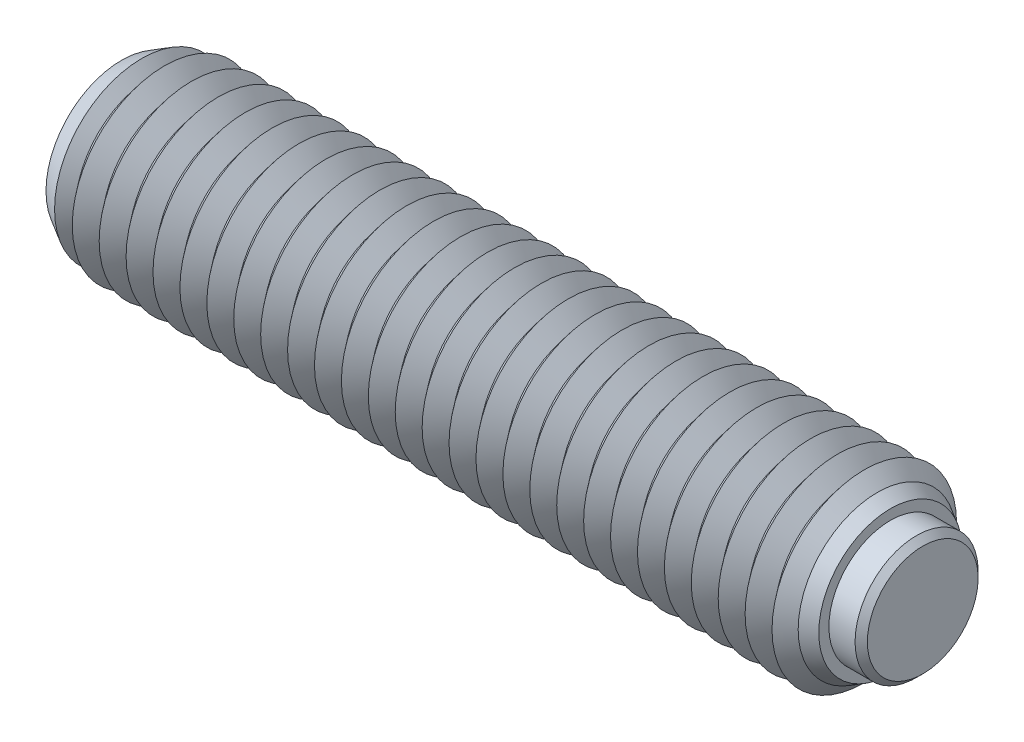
ISO-10303-21;
HEADER;
FILE_DESCRIPTION(('STEP AP214'),'2;1');
FILE_NAME('part.step','',(''),(''),'','','');
FILE_SCHEMA(('AUTOMOTIVE_DESIGN { 1 0 10303 214 1 1 1 1 }'));
ENDSEC;
DATA;
#1=APPLICATION_CONTEXT('core data for automotive mechanical design processes');
#2=APPLICATION_PROTOCOL_DEFINITION('international standard','automotive_design',2000,#1);
#3=PRODUCT_CONTEXT('',#1,'mechanical');
#4=PRODUCT('Part','Part','',(#3));
#5=PRODUCT_RELATED_PRODUCT_CATEGORY('part','',(#4));
#6=PRODUCT_DEFINITION_FORMATION('','',#4);
#7=PRODUCT_DEFINITION_CONTEXT('part definition',#1,'design');
#8=PRODUCT_DEFINITION('design','',#6,#7);
#9=PRODUCT_DEFINITION_SHAPE('','',#8);
#10=(LENGTH_UNIT() NAMED_UNIT(*) SI_UNIT(.MILLI.,.METRE.));
#11=(NAMED_UNIT(*) PLANE_ANGLE_UNIT() SI_UNIT($,.RADIAN.));
#12=(NAMED_UNIT(*) SI_UNIT($,.STERADIAN.) SOLID_ANGLE_UNIT());
#13=UNCERTAINTY_MEASURE_WITH_UNIT(LENGTH_MEASURE(1.E-05),#10,'distance_accuracy_value','');
#14=(GEOMETRIC_REPRESENTATION_CONTEXT(3) GLOBAL_UNCERTAINTY_ASSIGNED_CONTEXT((#13)) GLOBAL_UNIT_ASSIGNED_CONTEXT((#10,
#11,#12)) REPRESENTATION_CONTEXT('',''));
#15=CARTESIAN_POINT('',(0.,0.,0.));
#16=DIRECTION('',(0.,0.,1.));
#17=DIRECTION('',(1.,0.,0.));
#18=AXIS2_PLACEMENT_3D('',#15,#16,#17);
#19=CARTESIAN_POINT('',(2.95,0.,0.));
#20=DIRECTION('',(-1.,0.,0.));
#21=DIRECTION('',(0.,0.,1.));
#22=AXIS2_PLACEMENT_3D('',#19,#20,#21);
#23=CYLINDRICAL_SURFACE('',#22,4.);
#24=CARTESIAN_POINT('',(2.55,0.,0.));
#25=DIRECTION('',(1.,0.,0.));
#26=DIRECTION('',(0.,0.,-1.));
#27=AXIS2_PLACEMENT_3D('',#24,#25,#26);
#28=CIRCLE('',#27,4.);
#29=CARTESIAN_POINT('',(2.55,0.,4.));
#30=VERTEX_POINT('',#29);
#31=EDGE_CURVE('P0_E10',#30,#30,#28,.F.);
#32=ORIENTED_EDGE('',*,*,#31,.T.);
#33=EDGE_LOOP('',(#32));
#34=FACE_BOUND('',#33,.T.);
#35=CARTESIAN_POINT('',(-1.25,0.,0.));
#36=DIRECTION('',(1.,0.,0.));
#37=DIRECTION('',(0.,0.,-1.));
#38=AXIS2_PLACEMENT_3D('',#35,#36,#37);
#39=CIRCLE('',#38,4.);
#40=CARTESIAN_POINT('',(-1.25,0.,-4.));
#41=VERTEX_POINT('',#40);
#42=EDGE_CURVE('P0_E25',#41,#41,#39,.T.);
#43=ORIENTED_EDGE('',*,*,#42,.T.);
#44=EDGE_LOOP('',(#43));
#45=FACE_BOUND('',#44,.T.);
#46=ADVANCED_FACE('P0_F14',(#34,#45),#23,.T.);
#47=CARTESIAN_POINT('',(2.95,0.,0.));
#48=DIRECTION('',(1.,0.,0.));
#49=DIRECTION('',(0.,0.,-1.));
#50=AXIS2_PLACEMENT_3D('',#47,#48,#49);
#51=PLANE('',#50);
#52=CARTESIAN_POINT('',(2.95,0.,0.));
#53=DIRECTION('',(1.,0.,0.));
#54=DIRECTION('',(0.,0.,-1.));
#55=AXIS2_PLACEMENT_3D('',#52,#53,#54);
#56=CIRCLE('',#55,3.6);
#57=CARTESIAN_POINT('',(2.95,0.,3.6));
#58=VERTEX_POINT('',#57);
#59=EDGE_CURVE('P0_E21',#58,#58,#56,.T.);
#60=ORIENTED_EDGE('',*,*,#59,.T.);
#61=EDGE_LOOP('',(#60));
#62=FACE_BOUND('',#61,.T.);
#63=ADVANCED_FACE('P0_F35',(#62),#51,.T.);
#64=CARTESIAN_POINT('',(-1.25,0.,0.));
#65=DIRECTION('',(1.,0.,0.));
#66=DIRECTION('',(0.,0.,-1.));
#67=AXIS2_PLACEMENT_3D('',#64,#65,#66);
#68=PLANE('',#67);
#69=ORIENTED_EDGE('',*,*,#42,.F.);
#70=EDGE_LOOP('',(#69));
#71=FACE_BOUND('',#70,.T.);
#72=ADVANCED_FACE('P0_F33',(#71),#68,.F.);
#73=CARTESIAN_POINT('',(2.95,0.,0.));
#74=DIRECTION('',(-1.,0.,0.));
#75=DIRECTION('',(0.,0.,1.));
#76=AXIS2_PLACEMENT_3D('',#73,#74,#75);
#77=CONICAL_SURFACE('',#76,3.6,0.785398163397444);
#78=CARTESIAN_POINT('',(2.55,0.,4.));
#79=CARTESIAN_POINT('',(2.55416666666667,0.,3.99583333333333));
#80=CARTESIAN_POINT('',(2.55833333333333,0.,3.99166666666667));
#81=CARTESIAN_POINT('',(2.56666666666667,0.,3.98333333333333));
#82=CARTESIAN_POINT('',(2.57083333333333,0.,3.97916666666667));
#83=CARTESIAN_POINT('',(2.57916666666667,0.,3.97083333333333));
#84=CARTESIAN_POINT('',(2.58333333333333,0.,3.96666666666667));
#85=CARTESIAN_POINT('',(2.59166666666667,0.,3.95833333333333));
#86=CARTESIAN_POINT('',(2.59583333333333,0.,3.95416666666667));
#87=CARTESIAN_POINT('',(2.60416666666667,0.,3.94583333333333));
#88=CARTESIAN_POINT('',(2.60833333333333,0.,3.94166666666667));
#89=CARTESIAN_POINT('',(2.61666666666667,0.,3.93333333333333));
#90=CARTESIAN_POINT('',(2.62083333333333,0.,3.92916666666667));
#91=CARTESIAN_POINT('',(2.62916666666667,0.,3.92083333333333));
#92=CARTESIAN_POINT('',(2.63333333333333,0.,3.91666666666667));
#93=CARTESIAN_POINT('',(2.64166666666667,0.,3.90833333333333));
#94=CARTESIAN_POINT('',(2.64583333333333,0.,3.90416666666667));
#95=CARTESIAN_POINT('',(2.65416666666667,0.,3.89583333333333));
#96=CARTESIAN_POINT('',(2.65833333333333,0.,3.89166666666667));
#97=CARTESIAN_POINT('',(2.66666666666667,0.,3.88333333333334));
#98=CARTESIAN_POINT('',(2.67083333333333,0.,3.87916666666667));
#99=CARTESIAN_POINT('',(2.67916666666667,0.,3.87083333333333));
#100=CARTESIAN_POINT('',(2.68333333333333,0.,3.86666666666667));
#101=CARTESIAN_POINT('',(2.69166666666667,0.,3.85833333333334));
#102=CARTESIAN_POINT('',(2.69583333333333,0.,3.85416666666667));
#103=CARTESIAN_POINT('',(2.70416666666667,0.,3.84583333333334));
#104=CARTESIAN_POINT('',(2.70833333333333,0.,3.84166666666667));
#105=CARTESIAN_POINT('',(2.71666666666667,0.,3.83333333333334));
#106=CARTESIAN_POINT('',(2.72083333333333,0.,3.82916666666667));
#107=CARTESIAN_POINT('',(2.72916666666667,0.,3.82083333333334));
#108=CARTESIAN_POINT('',(2.73333333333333,0.,3.81666666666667));
#109=CARTESIAN_POINT('',(2.74166666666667,0.,3.80833333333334));
#110=CARTESIAN_POINT('',(2.74583333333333,0.,3.80416666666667));
#111=CARTESIAN_POINT('',(2.75416666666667,0.,3.79583333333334));
#112=CARTESIAN_POINT('',(2.75833333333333,0.,3.79166666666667));
#113=CARTESIAN_POINT('',(2.76666666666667,0.,3.78333333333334));
#114=CARTESIAN_POINT('',(2.77083333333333,0.,3.77916666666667));
#115=CARTESIAN_POINT('',(2.77916666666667,0.,3.77083333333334));
#116=CARTESIAN_POINT('',(2.78333333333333,0.,3.76666666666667));
#117=CARTESIAN_POINT('',(2.79166666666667,0.,3.75833333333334));
#118=CARTESIAN_POINT('',(2.79583333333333,0.,3.75416666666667));
#119=CARTESIAN_POINT('',(2.80416666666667,0.,3.74583333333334));
#120=CARTESIAN_POINT('',(2.80833333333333,0.,3.74166666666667));
#121=CARTESIAN_POINT('',(2.81666666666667,0.,3.73333333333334));
#122=CARTESIAN_POINT('',(2.82083333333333,0.,3.72916666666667));
#123=CARTESIAN_POINT('',(2.82916666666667,0.,3.72083333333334));
#124=CARTESIAN_POINT('',(2.83333333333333,0.,3.71666666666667));
#125=CARTESIAN_POINT('',(2.84166666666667,0.,3.70833333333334));
#126=CARTESIAN_POINT('',(2.84583333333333,0.,3.70416666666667));
#127=CARTESIAN_POINT('',(2.85416666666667,0.,3.69583333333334));
#128=CARTESIAN_POINT('',(2.85833333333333,0.,3.69166666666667));
#129=CARTESIAN_POINT('',(2.86666666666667,0.,3.68333333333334));
#130=CARTESIAN_POINT('',(2.87083333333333,0.,3.67916666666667));
#131=CARTESIAN_POINT('',(2.87916666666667,0.,3.67083333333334));
#132=CARTESIAN_POINT('',(2.88333333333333,0.,3.66666666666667));
#133=CARTESIAN_POINT('',(2.89166666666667,0.,3.65833333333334));
#134=CARTESIAN_POINT('',(2.89583333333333,0.,3.65416666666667));
#135=CARTESIAN_POINT('',(2.90416666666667,0.,3.64583333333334));
#136=CARTESIAN_POINT('',(2.90833333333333,0.,3.64166666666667));
#137=CARTESIAN_POINT('',(2.91666666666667,0.,3.63333333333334));
#138=CARTESIAN_POINT('',(2.92083333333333,0.,3.62916666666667));
#139=CARTESIAN_POINT('',(2.92916666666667,0.,3.62083333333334));
#140=CARTESIAN_POINT('',(2.93333333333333,0.,3.61666666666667));
#141=CARTESIAN_POINT('',(2.94166666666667,0.,3.60833333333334));
#142=CARTESIAN_POINT('',(2.94583333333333,0.,3.60416666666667));
#143=CARTESIAN_POINT('',(2.95,0.,3.6));
#144=B_SPLINE_CURVE_WITH_KNOTS('',3,(#78,#79,#80,#81,#82,#83,#84,#85,#86,#87,#88,#89,#90,#91,
#92,#93,#94,#95,#96,#97,#98,#99,#100,#101,#102,#103,#104,#105,#106,#107,#108,#109,#110,#111,
#112,#113,#114,#115,#116,#117,#118,#119,#120,#121,#122,#123,#124,#125,#126,#127,#128,#129,#130,
#131,#132,#133,#134,#135,#136,#137,#138,#139,#140,#141,#142,#143),.UNSPECIFIED.,.F.,.F.,(4,2,2,
2,2,2,2,2,2,2,2,2,2,2,2,2,2,2,2,2,2,2,2,2,2,2,2,2,2,2,2,2,4),(0.,0.0176776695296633,
0.0353553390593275,0.0530330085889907,0.070710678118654,0.0883883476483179,0.106066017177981,
0.123743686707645,0.141421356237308,0.159099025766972,0.176776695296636,0.194454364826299,
0.212132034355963,0.229809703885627,0.24748737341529,0.265165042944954,0.282842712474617,
0.300520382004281,0.318198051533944,0.335875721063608,0.353553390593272,0.371231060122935,
0.388908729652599,0.406586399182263,0.424264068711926,0.44194173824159,0.459619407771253,
0.477297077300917,0.49497474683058,0.512652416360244,0.530330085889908,0.548007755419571,
0.565685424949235),.UNSPECIFIED.);
#145=EDGE_CURVE('P0_BSEAM16',#30,#58,#144,.T.);
#146=ORIENTED_EDGE('',*,*,#31,.F.);
#147=ORIENTED_EDGE('',*,*,#59,.F.);
#148=ORIENTED_EDGE('',*,*,#145,.T.);
#149=ORIENTED_EDGE('',*,*,#145,.F.);
#150=EDGE_LOOP('',(#146,#148,#147,#149));
#151=FACE_BOUND('',#150,.T.);
#152=ADVANCED_FACE('P0_F16',(#151),#77,.T.);
#153=CLOSED_SHELL('',(#46,#63,#72,#152));
#154=MANIFOLD_SOLID_BREP('P0_B1',#153);
#155=CARTESIAN_POINT('',(-48.1,0.,0.));
#156=DIRECTION('',(-1.,0.,0.));
#157=DIRECTION('',(0.,0.,1.));
#158=AXIS2_PLACEMENT_3D('',#155,#156,#157);
#159=CONICAL_SURFACE('',#158,6.,0.895664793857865);
#160=CARTESIAN_POINT('',(-47.225,0.,0.));
#161=DIRECTION('',(1.,0.,0.));
#162=DIRECTION('',(0.,0.,-1.));
#163=AXIS2_PLACEMENT_3D('',#160,#161,#162);
#164=CIRCLE('',#163,4.90712535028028);
#165=CARTESIAN_POINT('',(-47.225,0.,-4.90712535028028));
#166=VERTEX_POINT('',#165);
#167=EDGE_CURVE('P1_E1191',#166,#166,#164,.T.);
#168=ORIENTED_EDGE('',*,*,#167,.F.);
#169=EDGE_LOOP('',(#168));
#170=FACE_BOUND('',#169,.T.);
#171=CARTESIAN_POINT('',(-47.8335357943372,0.,0.));
#172=DIRECTION('',(1.,0.,0.));
#173=DIRECTION('',(0.,0.,-1.));
#174=AXIS2_PLACEMENT_3D('',#171,#172,#173);
#175=CIRCLE('',#174,5.6671863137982);
#176=CARTESIAN_POINT('',(-47.8335357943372,0.,-5.6671863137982));
#177=VERTEX_POINT('',#176);
#178=EDGE_CURVE('P1_E1194',#177,#177,#175,.F.);
#179=ORIENTED_EDGE('',*,*,#178,.F.);
#180=EDGE_LOOP('',(#179));
#181=FACE_BOUND('',#180,.T.);
#182=ADVANCED_FACE('P1_F15',(#170,#181),#159,.T.);
#183=CARTESIAN_POINT('',(-1.725,0.,0.));
#184=DIRECTION('',(1.,0.,0.));
#185=DIRECTION('',(0.,0.,-1.));
#186=AXIS2_PLACEMENT_3D('',#183,#184,#185);
#187=CONICAL_SURFACE('',#186,4.90712535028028,0.895664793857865);
#188=CARTESIAN_POINT('',(-0.850000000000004,0.,0.));
#189=DIRECTION('',(1.,0.,0.));
#190=DIRECTION('',(0.,0.,-1.));
#191=AXIS2_PLACEMENT_3D('',#188,#189,#190);
#192=CIRCLE('',#191,6.);
#193=CARTESIAN_POINT('',(-0.850000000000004,0.,6.));
#194=VERTEX_POINT('',#193);
#195=EDGE_CURVE('P1_E1031',#194,#194,#192,.T.);
#196=ORIENTED_EDGE('',*,*,#195,.F.);
#197=EDGE_LOOP('',(#196));
#198=FACE_BOUND('',#197,.T.);
#199=CARTESIAN_POINT('',(-1.725,0.,0.));
#200=DIRECTION('',(1.,0.,0.));
#201=DIRECTION('',(0.,0.,-1.));
#202=AXIS2_PLACEMENT_3D('',#199,#200,#201);
#203=CIRCLE('',#202,4.90712535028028);
#204=CARTESIAN_POINT('',(-1.725,0.,-4.90712535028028));
#205=VERTEX_POINT('',#204);
#206=EDGE_CURVE('P1_E1032',#205,#205,#203,.T.);
#207=ORIENTED_EDGE('',*,*,#206,.T.);
#208=EDGE_LOOP('',(#207));
#209=FACE_BOUND('',#208,.T.);
#210=ADVANCED_FACE('P1_F222',(#198,#209),#187,.T.);
#211=CARTESIAN_POINT('',(-2.6,0.,0.));
#212=DIRECTION('',(-1.,0.,0.));
#213=DIRECTION('',(0.,0.,1.));
#214=AXIS2_PLACEMENT_3D('',#211,#212,#213);
#215=CONICAL_SURFACE('',#214,6.,0.895664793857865);
#216=ORIENTED_EDGE('',*,*,#206,.F.);
#217=EDGE_LOOP('',(#216));
#218=FACE_BOUND('',#217,.T.);
#219=CARTESIAN_POINT('',(-2.6,0.,0.));
#220=DIRECTION('',(1.,0.,0.));
#221=DIRECTION('',(0.,0.,-1.));
#222=AXIS2_PLACEMENT_3D('',#219,#220,#221);
#223=CIRCLE('',#222,6.);
#224=CARTESIAN_POINT('',(-2.6,0.,-6.));
#225=VERTEX_POINT('',#224);
#226=EDGE_CURVE('P1_E1036',#225,#225,#223,.T.);
#227=ORIENTED_EDGE('',*,*,#226,.T.);
#228=EDGE_LOOP('',(#227));
#229=FACE_BOUND('',#228,.T.);
#230=ADVANCED_FACE('P1_F227',(#218,#229),#215,.T.);
#231=CARTESIAN_POINT('',(-1.25,0.,0.));
#232=DIRECTION('',(1.,0.,0.));
#233=DIRECTION('',(0.,1.,0.));
#234=AXIS2_PLACEMENT_3D('',#231,#232,#233);
#235=PLANE('',#234);
#236=CARTESIAN_POINT('',(-1.25,0.,0.));
#237=DIRECTION('',(1.,0.,0.));
#238=DIRECTION('',(0.,1.,0.));
#239=AXIS2_PLACEMENT_3D('',#236,#237,#238);
#240=CIRCLE('',#239,4.);
#241=CARTESIAN_POINT('',(-1.25,4.,0.));
#242=VERTEX_POINT('',#241);
#243=EDGE_CURVE('P1_E510',#242,#242,#240,.T.);
#244=ORIENTED_EDGE('',*,*,#243,.T.);
#245=EDGE_LOOP('',(#244));
#246=FACE_BOUND('',#245,.T.);
#247=ADVANCED_FACE('P1_F437',(#246),#235,.T.);
#248=CARTESIAN_POINT('',(-1.25,0.,0.));
#249=DIRECTION('',(1.,0.,0.));
#250=DIRECTION('',(0.,1.,0.));
#251=AXIS2_PLACEMENT_3D('',#248,#249,#250);
#252=CYLINDRICAL_SURFACE('',#251,4.);
#253=ORIENTED_EDGE('',*,*,#243,.F.);
#254=EDGE_LOOP('',(#253));
#255=FACE_BOUND('',#254,.T.);
#256=CARTESIAN_POINT('',(0.85,0.,0.));
#257=DIRECTION('',(1.,0.,0.));
#258=DIRECTION('',(0.,1.,0.));
#259=AXIS2_PLACEMENT_3D('',#256,#257,#258);
#260=CIRCLE('',#259,4.);
#261=CARTESIAN_POINT('',(0.85,4.,0.));
#262=VERTEX_POINT('',#261);
#263=EDGE_CURVE('P1_E513',#262,#262,#260,.T.);
#264=ORIENTED_EDGE('',*,*,#263,.T.);
#265=EDGE_LOOP('',(#264));
#266=FACE_BOUND('',#265,.T.);
#267=ADVANCED_FACE('P1_F209',(#255,#266),#252,.F.);
#268=CARTESIAN_POINT('',(0.849999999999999,4.65925227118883,0.));
#269=DIRECTION('',(1.,0.,0.));
#270=DIRECTION('',(0.,1.,0.));
#271=AXIS2_PLACEMENT_3D('',#268,#269,#270);
#272=PLANE('',#271);
#273=ORIENTED_EDGE('',*,*,#263,.F.);
#274=EDGE_LOOP('',(#273));
#275=FACE_BOUND('',#274,.T.);
#276=CARTESIAN_POINT('',(0.85,0.,0.));
#277=DIRECTION('',(1.,0.,0.));
#278=DIRECTION('',(0.,1.,0.));
#279=AXIS2_PLACEMENT_3D('',#276,#277,#278);
#280=CIRCLE('',#279,4.65925227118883);
#281=CARTESIAN_POINT('',(0.849999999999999,4.65925227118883,0.));
#282=VERTEX_POINT('',#281);
#283=EDGE_CURVE('P1_E121',#282,#282,#280,.T.);
#284=ORIENTED_EDGE('',*,*,#283,.T.);
#285=EDGE_LOOP('',(#284));
#286=FACE_BOUND('',#285,.T.);
#287=ADVANCED_FACE('P1_F206',(#275,#286),#272,.T.);
#288=CARTESIAN_POINT('',(0.85,0.,0.));
#289=DIRECTION('',(-1.,0.,0.));
#290=DIRECTION('',(0.,-1.,0.));
#291=AXIS2_PLACEMENT_3D('',#288,#289,#290);
#292=CONICAL_SURFACE('',#291,4.65925227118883,0.523598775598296);
#293=CARTESIAN_POINT('',(0.,0.,0.));
#294=DIRECTION('',(1.,0.,0.));
#295=DIRECTION('',(0.,0.,-1.));
#296=AXIS2_PLACEMENT_3D('',#293,#294,#295);
#297=CIRCLE('',#296,5.15000000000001);
#298=CARTESIAN_POINT('',(0.,0.,5.15000000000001));
#299=VERTEX_POINT('',#298);
#300=EDGE_CURVE('P1_E501',#299,#299,#297,.T.);
#301=ORIENTED_EDGE('',*,*,#300,.T.);
#302=EDGE_LOOP('',(#301));
#303=FACE_BOUND('',#302,.T.);
#304=ORIENTED_EDGE('',*,*,#283,.F.);
#305=EDGE_LOOP('',(#304));
#306=FACE_BOUND('',#305,.T.);
#307=ADVANCED_FACE('P1_F203',(#303,#306),#292,.T.);
#308=CARTESIAN_POINT('',(0.,0.,0.));
#309=DIRECTION('',(-1.,0.,0.));
#310=DIRECTION('',(0.,0.,1.));
#311=AXIS2_PLACEMENT_3D('',#308,#309,#310);
#312=CONICAL_SURFACE('',#311,5.15000000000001,0.785398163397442);
#313=CARTESIAN_POINT('',(-0.850000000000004,0.,6.));
#314=CARTESIAN_POINT('',(-0.841145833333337,0.,5.99114583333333));
#315=CARTESIAN_POINT('',(-0.83229166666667,0.,5.98229166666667));
#316=CARTESIAN_POINT('',(-0.814583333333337,0.,5.96458333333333));
#317=CARTESIAN_POINT('',(-0.80572916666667,0.,5.95572916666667));
#318=CARTESIAN_POINT('',(-0.788020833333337,0.,5.93802083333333));
#319=CARTESIAN_POINT('',(-0.77916666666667,0.,5.92916666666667));
#320=CARTESIAN_POINT('',(-0.761458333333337,0.,5.91145833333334));
#321=CARTESIAN_POINT('',(-0.75260416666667,0.,5.90260416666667));
#322=CARTESIAN_POINT('',(-0.734895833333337,0.,5.88489583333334));
#323=CARTESIAN_POINT('',(-0.72604166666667,0.,5.87604166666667));
#324=CARTESIAN_POINT('',(-0.708333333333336,0.,5.85833333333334));
#325=CARTESIAN_POINT('',(-0.69947916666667,0.,5.84947916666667));
#326=CARTESIAN_POINT('',(-0.681770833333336,0.,5.83177083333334));
#327=CARTESIAN_POINT('',(-0.672916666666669,0.,5.82291666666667));
#328=CARTESIAN_POINT('',(-0.655208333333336,0.,5.80520833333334));
#329=CARTESIAN_POINT('',(-0.64635416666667,0.,5.79635416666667));
#330=CARTESIAN_POINT('',(-0.628645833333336,0.,5.77864583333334));
#331=CARTESIAN_POINT('',(-0.619791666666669,0.,5.76979166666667));
#332=CARTESIAN_POINT('',(-0.602083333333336,0.,5.75208333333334));
#333=CARTESIAN_POINT('',(-0.593229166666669,0.,5.74322916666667));
#334=CARTESIAN_POINT('',(-0.575520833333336,0.,5.72552083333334));
#335=CARTESIAN_POINT('',(-0.566666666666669,0.,5.71666666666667));
#336=CARTESIAN_POINT('',(-0.548958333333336,0.,5.69895833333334));
#337=CARTESIAN_POINT('',(-0.540104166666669,0.,5.69010416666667));
#338=CARTESIAN_POINT('',(-0.522395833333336,0.,5.67239583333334));
#339=CARTESIAN_POINT('',(-0.513541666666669,0.,5.66354166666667));
#340=CARTESIAN_POINT('',(-0.495833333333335,0.,5.64583333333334));
#341=CARTESIAN_POINT('',(-0.486979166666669,0.,5.63697916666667));
#342=CARTESIAN_POINT('',(-0.469270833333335,0.,5.61927083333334));
#343=CARTESIAN_POINT('',(-0.460416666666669,0.,5.61041666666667));
#344=CARTESIAN_POINT('',(-0.442708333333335,0.,5.59270833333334));
#345=CARTESIAN_POINT('',(-0.433854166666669,0.,5.58385416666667));
#346=CARTESIAN_POINT('',(-0.416145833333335,0.,5.56614583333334));
#347=CARTESIAN_POINT('',(-0.407291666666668,0.,5.55729166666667));
#348=CARTESIAN_POINT('',(-0.389583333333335,0.,5.53958333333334));
#349=CARTESIAN_POINT('',(-0.380729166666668,0.,5.53072916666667));
#350=CARTESIAN_POINT('',(-0.363020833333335,0.,5.51302083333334));
#351=CARTESIAN_POINT('',(-0.354166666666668,0.,5.50416666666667));
#352=CARTESIAN_POINT('',(-0.336458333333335,0.,5.48645833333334));
#353=CARTESIAN_POINT('',(-0.327604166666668,0.,5.47760416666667));
#354=CARTESIAN_POINT('',(-0.309895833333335,0.,5.45989583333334));
#355=CARTESIAN_POINT('',(-0.301041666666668,0.,5.45104166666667));
#356=CARTESIAN_POINT('',(-0.283333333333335,0.,5.43333333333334));
#357=CARTESIAN_POINT('',(-0.274479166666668,0.,5.42447916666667));
#358=CARTESIAN_POINT('',(-0.256770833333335,0.,5.40677083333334));
#359=CARTESIAN_POINT('',(-0.247916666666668,0.,5.39791666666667));
#360=CARTESIAN_POINT('',(-0.230208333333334,0.,5.38020833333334));
#361=CARTESIAN_POINT('',(-0.221354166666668,0.,5.37135416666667));
#362=CARTESIAN_POINT('',(-0.203645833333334,0.,5.35364583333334));
#363=CARTESIAN_POINT('',(-0.194791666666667,0.,5.34479166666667));
#364=CARTESIAN_POINT('',(-0.177083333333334,0.,5.32708333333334));
#365=CARTESIAN_POINT('',(-0.168229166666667,0.,5.31822916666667));
#366=CARTESIAN_POINT('',(-0.150520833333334,0.,5.30052083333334));
#367=CARTESIAN_POINT('',(-0.141666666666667,0.,5.29166666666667));
#368=CARTESIAN_POINT('',(-0.123958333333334,0.,5.27395833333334));
#369=CARTESIAN_POINT('',(-0.115104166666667,0.,5.26510416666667));
#370=CARTESIAN_POINT('',(-0.0973958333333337,0.,5.24739583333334));
#371=CARTESIAN_POINT('',(-0.088541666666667,0.,5.23854166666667));
#372=CARTESIAN_POINT('',(-0.0708333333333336,0.,5.22083333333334));
#373=CARTESIAN_POINT('',(-0.0619791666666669,0.,5.21197916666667));
#374=CARTESIAN_POINT('',(-0.0442708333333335,0.,5.19427083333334));
#375=CARTESIAN_POINT('',(-0.0354166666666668,0.,5.18541666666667));
#376=CARTESIAN_POINT('',(-0.0177083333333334,0.,5.16770833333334));
#377=CARTESIAN_POINT('',(-0.00885416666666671,0.,5.15885416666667));
#378=CARTESIAN_POINT('',(0.,0.,5.15000000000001));
#379=B_SPLINE_CURVE_WITH_KNOTS('',3,(#313,#314,#315,#316,#317,#318,#319,#320,#321,#322,#323,
#324,#325,#326,#327,#328,#329,#330,#331,#332,#333,#334,#335,#336,#337,#338,#339,#340,#341,#342,
#343,#344,#345,#346,#347,#348,#349,#350,#351,#352,#353,#354,#355,#356,#357,#358,#359,#360,#361,
#362,#363,#364,#365,#366,#367,#368,#369,#370,#371,#372,#373,#374,#375,#376,#377,#378),
.UNSPECIFIED.,.F.,.F.,(4,2,2,2,2,2,2,2,2,2,2,2,2,2,2,2,2,2,2,2,2,2,2,2,2,2,2,2,2,2,2,2,4),(0.,
0.0375650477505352,0.0751300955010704,0.112695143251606,0.150260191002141,0.187825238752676,
0.225390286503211,0.262955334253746,0.300520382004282,0.338085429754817,0.375650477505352,
0.413215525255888,0.450780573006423,0.488345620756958,0.525910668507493,0.563475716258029,
0.601040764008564,0.638605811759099,0.676170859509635,0.71373590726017,0.751300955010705,
0.78886600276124,0.826431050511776,0.863996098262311,0.901561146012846,0.939126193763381,
0.976691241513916,1.01425628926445,1.05182133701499,1.08938638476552,1.12695143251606,
1.16451648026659,1.20208152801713),.UNSPECIFIED.);
#380=EDGE_CURVE('P1_BSEAM17',#194,#299,#379,.T.);
#381=ORIENTED_EDGE('',*,*,#195,.T.);
#382=ORIENTED_EDGE('',*,*,#300,.F.);
#383=ORIENTED_EDGE('',*,*,#380,.T.);
#384=ORIENTED_EDGE('',*,*,#380,.F.);
#385=EDGE_LOOP('',(#381,#383,#382,#384));
#386=FACE_BOUND('',#385,.T.);
#387=ADVANCED_FACE('P1_F17',(#386),#312,.T.);
#388=CARTESIAN_POINT('',(-3.475,0.,0.));
#389=DIRECTION('',(1.,0.,0.));
#390=DIRECTION('',(0.,0.,-1.));
#391=AXIS2_PLACEMENT_3D('',#388,#389,#390);
#392=CONICAL_SURFACE('',#391,4.90712535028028,0.895664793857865);
#393=ORIENTED_EDGE('',*,*,#226,.F.);
#394=EDGE_LOOP('',(#393));
#395=FACE_BOUND('',#394,.T.);
#396=CARTESIAN_POINT('',(-3.475,0.,0.));
#397=DIRECTION('',(1.,0.,0.));
#398=DIRECTION('',(0.,0.,-1.));
#399=AXIS2_PLACEMENT_3D('',#396,#397,#398);
#400=CIRCLE('',#399,4.90712535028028);
#401=CARTESIAN_POINT('',(-3.475,0.,-4.90712535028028));
#402=VERTEX_POINT('',#401);
#403=EDGE_CURVE('P1_E1041',#402,#402,#400,.T.);
#404=ORIENTED_EDGE('',*,*,#403,.T.);
#405=EDGE_LOOP('',(#404));
#406=FACE_BOUND('',#405,.T.);
#407=ADVANCED_FACE('P1_F431',(#395,#406),#392,.T.);
#408=CARTESIAN_POINT('',(-4.35,0.,0.));
#409=DIRECTION('',(-1.,0.,0.));
#410=DIRECTION('',(0.,0.,1.));
#411=AXIS2_PLACEMENT_3D('',#408,#409,#410);
#412=CONICAL_SURFACE('',#411,6.,0.895664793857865);
#413=ORIENTED_EDGE('',*,*,#403,.F.);
#414=EDGE_LOOP('',(#413));
#415=FACE_BOUND('',#414,.T.);
#416=CARTESIAN_POINT('',(-4.35,0.,0.));
#417=DIRECTION('',(1.,0.,0.));
#418=DIRECTION('',(0.,0.,-1.));
#419=AXIS2_PLACEMENT_3D('',#416,#417,#418);
#420=CIRCLE('',#419,6.);
#421=CARTESIAN_POINT('',(-4.35,0.,-6.));
#422=VERTEX_POINT('',#421);
#423=EDGE_CURVE('P1_E1044',#422,#422,#420,.T.);
#424=ORIENTED_EDGE('',*,*,#423,.T.);
#425=EDGE_LOOP('',(#424));
#426=FACE_BOUND('',#425,.T.);
#427=ADVANCED_FACE('P1_F427',(#415,#426),#412,.T.);
#428=CARTESIAN_POINT('',(-5.225,0.,0.));
#429=DIRECTION('',(1.,0.,0.));
#430=DIRECTION('',(0.,0.,-1.));
#431=AXIS2_PLACEMENT_3D('',#428,#429,#430);
#432=CONICAL_SURFACE('',#431,4.90712535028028,0.895664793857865);
#433=ORIENTED_EDGE('',*,*,#423,.F.);
#434=EDGE_LOOP('',(#433));
#435=FACE_BOUND('',#434,.T.);
#436=CARTESIAN_POINT('',(-5.225,0.,0.));
#437=DIRECTION('',(1.,0.,0.));
#438=DIRECTION('',(0.,0.,-1.));
#439=AXIS2_PLACEMENT_3D('',#436,#437,#438);
#440=CIRCLE('',#439,4.90712535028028);
#441=CARTESIAN_POINT('',(-5.225,0.,-4.90712535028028));
#442=VERTEX_POINT('',#441);
#443=EDGE_CURVE('P1_E1047',#442,#442,#440,.T.);
#444=ORIENTED_EDGE('',*,*,#443,.T.);
#445=EDGE_LOOP('',(#444));
#446=FACE_BOUND('',#445,.T.);
#447=ADVANCED_FACE('P1_F423',(#435,#446),#432,.T.);
#448=CARTESIAN_POINT('',(-6.1,0.,0.));
#449=DIRECTION('',(-1.,0.,0.));
#450=DIRECTION('',(0.,0.,1.));
#451=AXIS2_PLACEMENT_3D('',#448,#449,#450);
#452=CONICAL_SURFACE('',#451,6.,0.895664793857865);
#453=ORIENTED_EDGE('',*,*,#443,.F.);
#454=EDGE_LOOP('',(#453));
#455=FACE_BOUND('',#454,.T.);
#456=CARTESIAN_POINT('',(-6.1,0.,0.));
#457=DIRECTION('',(1.,0.,0.));
#458=DIRECTION('',(0.,0.,-1.));
#459=AXIS2_PLACEMENT_3D('',#456,#457,#458);
#460=CIRCLE('',#459,6.);
#461=CARTESIAN_POINT('',(-6.1,0.,-6.));
#462=VERTEX_POINT('',#461);
#463=EDGE_CURVE('P1_E1050',#462,#462,#460,.T.);
#464=ORIENTED_EDGE('',*,*,#463,.T.);
#465=EDGE_LOOP('',(#464));
#466=FACE_BOUND('',#465,.T.);
#467=ADVANCED_FACE('P1_F419',(#455,#466),#452,.T.);
#468=CARTESIAN_POINT('',(-6.975,0.,0.));
#469=DIRECTION('',(1.,0.,0.));
#470=DIRECTION('',(0.,0.,-1.));
#471=AXIS2_PLACEMENT_3D('',#468,#469,#470);
#472=CONICAL_SURFACE('',#471,4.90712535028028,0.895664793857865);
#473=ORIENTED_EDGE('',*,*,#463,.F.);
#474=EDGE_LOOP('',(#473));
#475=FACE_BOUND('',#474,.T.);
#476=CARTESIAN_POINT('',(-6.975,0.,0.));
#477=DIRECTION('',(1.,0.,0.));
#478=DIRECTION('',(0.,0.,-1.));
#479=AXIS2_PLACEMENT_3D('',#476,#477,#478);
#480=CIRCLE('',#479,4.90712535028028);
#481=CARTESIAN_POINT('',(-6.975,0.,-4.90712535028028));
#482=VERTEX_POINT('',#481);
#483=EDGE_CURVE('P1_E1053',#482,#482,#480,.T.);
#484=ORIENTED_EDGE('',*,*,#483,.T.);
#485=EDGE_LOOP('',(#484));
#486=FACE_BOUND('',#485,.T.);
#487=ADVANCED_FACE('P1_F415',(#475,#486),#472,.T.);
#488=CARTESIAN_POINT('',(-7.85,0.,0.));
#489=DIRECTION('',(-1.,0.,0.));
#490=DIRECTION('',(0.,0.,1.));
#491=AXIS2_PLACEMENT_3D('',#488,#489,#490);
#492=CONICAL_SURFACE('',#491,6.,0.895664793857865);
#493=ORIENTED_EDGE('',*,*,#483,.F.);
#494=EDGE_LOOP('',(#493));
#495=FACE_BOUND('',#494,.T.);
#496=CARTESIAN_POINT('',(-7.85,0.,0.));
#497=DIRECTION('',(1.,0.,0.));
#498=DIRECTION('',(0.,0.,-1.));
#499=AXIS2_PLACEMENT_3D('',#496,#497,#498);
#500=CIRCLE('',#499,6.);
#501=CARTESIAN_POINT('',(-7.85,0.,-6.));
#502=VERTEX_POINT('',#501);
#503=EDGE_CURVE('P1_E1056',#502,#502,#500,.T.);
#504=ORIENTED_EDGE('',*,*,#503,.T.);
#505=EDGE_LOOP('',(#504));
#506=FACE_BOUND('',#505,.T.);
#507=ADVANCED_FACE('P1_F411',(#495,#506),#492,.T.);
#508=CARTESIAN_POINT('',(-8.725,0.,0.));
#509=DIRECTION('',(1.,0.,0.));
#510=DIRECTION('',(0.,0.,-1.));
#511=AXIS2_PLACEMENT_3D('',#508,#509,#510);
#512=CONICAL_SURFACE('',#511,4.90712535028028,0.895664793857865);
#513=ORIENTED_EDGE('',*,*,#503,.F.);
#514=EDGE_LOOP('',(#513));
#515=FACE_BOUND('',#514,.T.);
#516=CARTESIAN_POINT('',(-8.725,0.,0.));
#517=DIRECTION('',(1.,0.,0.));
#518=DIRECTION('',(0.,0.,-1.));
#519=AXIS2_PLACEMENT_3D('',#516,#517,#518);
#520=CIRCLE('',#519,4.90712535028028);
#521=CARTESIAN_POINT('',(-8.725,0.,-4.90712535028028));
#522=VERTEX_POINT('',#521);
#523=EDGE_CURVE('P1_E1059',#522,#522,#520,.T.);
#524=ORIENTED_EDGE('',*,*,#523,.T.);
#525=EDGE_LOOP('',(#524));
#526=FACE_BOUND('',#525,.T.);
#527=ADVANCED_FACE('P1_F407',(#515,#526),#512,.T.);
#528=CARTESIAN_POINT('',(-9.6,0.,0.));
#529=DIRECTION('',(-1.,0.,0.));
#530=DIRECTION('',(0.,0.,1.));
#531=AXIS2_PLACEMENT_3D('',#528,#529,#530);
#532=CONICAL_SURFACE('',#531,6.,0.895664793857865);
#533=ORIENTED_EDGE('',*,*,#523,.F.);
#534=EDGE_LOOP('',(#533));
#535=FACE_BOUND('',#534,.T.);
#536=CARTESIAN_POINT('',(-9.6,0.,0.));
#537=DIRECTION('',(1.,0.,0.));
#538=DIRECTION('',(0.,0.,-1.));
#539=AXIS2_PLACEMENT_3D('',#536,#537,#538);
#540=CIRCLE('',#539,6.);
#541=CARTESIAN_POINT('',(-9.6,0.,-6.));
#542=VERTEX_POINT('',#541);
#543=EDGE_CURVE('P1_E1062',#542,#542,#540,.T.);
#544=ORIENTED_EDGE('',*,*,#543,.T.);
#545=EDGE_LOOP('',(#544));
#546=FACE_BOUND('',#545,.T.);
#547=ADVANCED_FACE('P1_F403',(#535,#546),#532,.T.);
#548=CARTESIAN_POINT('',(-10.475,0.,0.));
#549=DIRECTION('',(1.,0.,0.));
#550=DIRECTION('',(0.,0.,-1.));
#551=AXIS2_PLACEMENT_3D('',#548,#549,#550);
#552=CONICAL_SURFACE('',#551,4.90712535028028,0.895664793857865);
#553=ORIENTED_EDGE('',*,*,#543,.F.);
#554=EDGE_LOOP('',(#553));
#555=FACE_BOUND('',#554,.T.);
#556=CARTESIAN_POINT('',(-10.475,0.,0.));
#557=DIRECTION('',(1.,0.,0.));
#558=DIRECTION('',(0.,0.,-1.));
#559=AXIS2_PLACEMENT_3D('',#556,#557,#558);
#560=CIRCLE('',#559,4.90712535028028);
#561=CARTESIAN_POINT('',(-10.475,0.,-4.90712535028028));
#562=VERTEX_POINT('',#561);
#563=EDGE_CURVE('P1_E1065',#562,#562,#560,.T.);
#564=ORIENTED_EDGE('',*,*,#563,.T.);
#565=EDGE_LOOP('',(#564));
#566=FACE_BOUND('',#565,.T.);
#567=ADVANCED_FACE('P1_F399',(#555,#566),#552,.T.);
#568=CARTESIAN_POINT('',(-11.35,0.,0.));
#569=DIRECTION('',(-1.,0.,0.));
#570=DIRECTION('',(0.,0.,1.));
#571=AXIS2_PLACEMENT_3D('',#568,#569,#570);
#572=CONICAL_SURFACE('',#571,6.,0.895664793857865);
#573=ORIENTED_EDGE('',*,*,#563,.F.);
#574=EDGE_LOOP('',(#573));
#575=FACE_BOUND('',#574,.T.);
#576=CARTESIAN_POINT('',(-11.35,0.,0.));
#577=DIRECTION('',(1.,0.,0.));
#578=DIRECTION('',(0.,0.,-1.));
#579=AXIS2_PLACEMENT_3D('',#576,#577,#578);
#580=CIRCLE('',#579,6.);
#581=CARTESIAN_POINT('',(-11.35,0.,-6.));
#582=VERTEX_POINT('',#581);
#583=EDGE_CURVE('P1_E1068',#582,#582,#580,.T.);
#584=ORIENTED_EDGE('',*,*,#583,.T.);
#585=EDGE_LOOP('',(#584));
#586=FACE_BOUND('',#585,.T.);
#587=ADVANCED_FACE('P1_F395',(#575,#586),#572,.T.);
#588=CARTESIAN_POINT('',(-12.225,0.,0.));
#589=DIRECTION('',(1.,0.,0.));
#590=DIRECTION('',(0.,0.,-1.));
#591=AXIS2_PLACEMENT_3D('',#588,#589,#590);
#592=CONICAL_SURFACE('',#591,4.90712535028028,0.895664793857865);
#593=ORIENTED_EDGE('',*,*,#583,.F.);
#594=EDGE_LOOP('',(#593));
#595=FACE_BOUND('',#594,.T.);
#596=CARTESIAN_POINT('',(-12.225,0.,0.));
#597=DIRECTION('',(1.,0.,0.));
#598=DIRECTION('',(0.,0.,-1.));
#599=AXIS2_PLACEMENT_3D('',#596,#597,#598);
#600=CIRCLE('',#599,4.90712535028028);
#601=CARTESIAN_POINT('',(-12.225,0.,-4.90712535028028));
#602=VERTEX_POINT('',#601);
#603=EDGE_CURVE('P1_E1071',#602,#602,#600,.T.);
#604=ORIENTED_EDGE('',*,*,#603,.T.);
#605=EDGE_LOOP('',(#604));
#606=FACE_BOUND('',#605,.T.);
#607=ADVANCED_FACE('P1_F391',(#595,#606),#592,.T.);
#608=CARTESIAN_POINT('',(-13.1,0.,0.));
#609=DIRECTION('',(-1.,0.,0.));
#610=DIRECTION('',(0.,0.,1.));
#611=AXIS2_PLACEMENT_3D('',#608,#609,#610);
#612=CONICAL_SURFACE('',#611,6.,0.895664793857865);
#613=ORIENTED_EDGE('',*,*,#603,.F.);
#614=EDGE_LOOP('',(#613));
#615=FACE_BOUND('',#614,.T.);
#616=CARTESIAN_POINT('',(-13.1,0.,0.));
#617=DIRECTION('',(1.,0.,0.));
#618=DIRECTION('',(0.,0.,-1.));
#619=AXIS2_PLACEMENT_3D('',#616,#617,#618);
#620=CIRCLE('',#619,6.);
#621=CARTESIAN_POINT('',(-13.1,0.,-6.));
#622=VERTEX_POINT('',#621);
#623=EDGE_CURVE('P1_E1074',#622,#622,#620,.T.);
#624=ORIENTED_EDGE('',*,*,#623,.T.);
#625=EDGE_LOOP('',(#624));
#626=FACE_BOUND('',#625,.T.);
#627=ADVANCED_FACE('P1_F387',(#615,#626),#612,.T.);
#628=CARTESIAN_POINT('',(-13.975,0.,0.));
#629=DIRECTION('',(1.,0.,0.));
#630=DIRECTION('',(0.,0.,-1.));
#631=AXIS2_PLACEMENT_3D('',#628,#629,#630);
#632=CONICAL_SURFACE('',#631,4.90712535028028,0.895664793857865);
#633=ORIENTED_EDGE('',*,*,#623,.F.);
#634=EDGE_LOOP('',(#633));
#635=FACE_BOUND('',#634,.T.);
#636=CARTESIAN_POINT('',(-13.975,0.,0.));
#637=DIRECTION('',(1.,0.,0.));
#638=DIRECTION('',(0.,0.,-1.));
#639=AXIS2_PLACEMENT_3D('',#636,#637,#638);
#640=CIRCLE('',#639,4.90712535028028);
#641=CARTESIAN_POINT('',(-13.975,0.,-4.90712535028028));
#642=VERTEX_POINT('',#641);
#643=EDGE_CURVE('P1_E1077',#642,#642,#640,.T.);
#644=ORIENTED_EDGE('',*,*,#643,.T.);
#645=EDGE_LOOP('',(#644));
#646=FACE_BOUND('',#645,.T.);
#647=ADVANCED_FACE('P1_F383',(#635,#646),#632,.T.);
#648=CARTESIAN_POINT('',(-14.85,0.,0.));
#649=DIRECTION('',(-1.,0.,0.));
#650=DIRECTION('',(0.,0.,1.));
#651=AXIS2_PLACEMENT_3D('',#648,#649,#650);
#652=CONICAL_SURFACE('',#651,6.,0.895664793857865);
#653=ORIENTED_EDGE('',*,*,#643,.F.);
#654=EDGE_LOOP('',(#653));
#655=FACE_BOUND('',#654,.T.);
#656=CARTESIAN_POINT('',(-14.85,0.,0.));
#657=DIRECTION('',(1.,0.,0.));
#658=DIRECTION('',(0.,0.,-1.));
#659=AXIS2_PLACEMENT_3D('',#656,#657,#658);
#660=CIRCLE('',#659,6.);
#661=CARTESIAN_POINT('',(-14.85,0.,-6.));
#662=VERTEX_POINT('',#661);
#663=EDGE_CURVE('P1_E1080',#662,#662,#660,.T.);
#664=ORIENTED_EDGE('',*,*,#663,.T.);
#665=EDGE_LOOP('',(#664));
#666=FACE_BOUND('',#665,.T.);
#667=ADVANCED_FACE('P1_F379',(#655,#666),#652,.T.);
#668=CARTESIAN_POINT('',(-15.725,0.,0.));
#669=DIRECTION('',(1.,0.,0.));
#670=DIRECTION('',(0.,0.,-1.));
#671=AXIS2_PLACEMENT_3D('',#668,#669,#670);
#672=CONICAL_SURFACE('',#671,4.90712535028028,0.895664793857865);
#673=ORIENTED_EDGE('',*,*,#663,.F.);
#674=EDGE_LOOP('',(#673));
#675=FACE_BOUND('',#674,.T.);
#676=CARTESIAN_POINT('',(-15.725,0.,0.));
#677=DIRECTION('',(1.,0.,0.));
#678=DIRECTION('',(0.,0.,-1.));
#679=AXIS2_PLACEMENT_3D('',#676,#677,#678);
#680=CIRCLE('',#679,4.90712535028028);
#681=CARTESIAN_POINT('',(-15.725,0.,-4.90712535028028));
#682=VERTEX_POINT('',#681);
#683=EDGE_CURVE('P1_E1083',#682,#682,#680,.T.);
#684=ORIENTED_EDGE('',*,*,#683,.T.);
#685=EDGE_LOOP('',(#684));
#686=FACE_BOUND('',#685,.T.);
#687=ADVANCED_FACE('P1_F375',(#675,#686),#672,.T.);
#688=CARTESIAN_POINT('',(-16.6,0.,0.));
#689=DIRECTION('',(-1.,0.,0.));
#690=DIRECTION('',(0.,0.,1.));
#691=AXIS2_PLACEMENT_3D('',#688,#689,#690);
#692=CONICAL_SURFACE('',#691,6.,0.895664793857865);
#693=ORIENTED_EDGE('',*,*,#683,.F.);
#694=EDGE_LOOP('',(#693));
#695=FACE_BOUND('',#694,.T.);
#696=CARTESIAN_POINT('',(-16.6,0.,0.));
#697=DIRECTION('',(1.,0.,0.));
#698=DIRECTION('',(0.,0.,-1.));
#699=AXIS2_PLACEMENT_3D('',#696,#697,#698);
#700=CIRCLE('',#699,6.);
#701=CARTESIAN_POINT('',(-16.6,0.,-6.));
#702=VERTEX_POINT('',#701);
#703=EDGE_CURVE('P1_E1086',#702,#702,#700,.T.);
#704=ORIENTED_EDGE('',*,*,#703,.T.);
#705=EDGE_LOOP('',(#704));
#706=FACE_BOUND('',#705,.T.);
#707=ADVANCED_FACE('P1_F371',(#695,#706),#692,.T.);
#708=CARTESIAN_POINT('',(-17.475,0.,0.));
#709=DIRECTION('',(1.,0.,0.));
#710=DIRECTION('',(0.,0.,-1.));
#711=AXIS2_PLACEMENT_3D('',#708,#709,#710);
#712=CONICAL_SURFACE('',#711,4.90712535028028,0.895664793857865);
#713=ORIENTED_EDGE('',*,*,#703,.F.);
#714=EDGE_LOOP('',(#713));
#715=FACE_BOUND('',#714,.T.);
#716=CARTESIAN_POINT('',(-17.475,0.,0.));
#717=DIRECTION('',(1.,0.,0.));
#718=DIRECTION('',(0.,0.,-1.));
#719=AXIS2_PLACEMENT_3D('',#716,#717,#718);
#720=CIRCLE('',#719,4.90712535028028);
#721=CARTESIAN_POINT('',(-17.475,0.,-4.90712535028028));
#722=VERTEX_POINT('',#721);
#723=EDGE_CURVE('P1_E1089',#722,#722,#720,.T.);
#724=ORIENTED_EDGE('',*,*,#723,.T.);
#725=EDGE_LOOP('',(#724));
#726=FACE_BOUND('',#725,.T.);
#727=ADVANCED_FACE('P1_F367',(#715,#726),#712,.T.);
#728=CARTESIAN_POINT('',(-18.35,0.,0.));
#729=DIRECTION('',(-1.,0.,0.));
#730=DIRECTION('',(0.,0.,1.));
#731=AXIS2_PLACEMENT_3D('',#728,#729,#730);
#732=CONICAL_SURFACE('',#731,6.,0.895664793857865);
#733=ORIENTED_EDGE('',*,*,#723,.F.);
#734=EDGE_LOOP('',(#733));
#735=FACE_BOUND('',#734,.T.);
#736=CARTESIAN_POINT('',(-18.35,0.,0.));
#737=DIRECTION('',(1.,0.,0.));
#738=DIRECTION('',(0.,0.,-1.));
#739=AXIS2_PLACEMENT_3D('',#736,#737,#738);
#740=CIRCLE('',#739,6.);
#741=CARTESIAN_POINT('',(-18.35,0.,-6.));
#742=VERTEX_POINT('',#741);
#743=EDGE_CURVE('P1_E1092',#742,#742,#740,.T.);
#744=ORIENTED_EDGE('',*,*,#743,.T.);
#745=EDGE_LOOP('',(#744));
#746=FACE_BOUND('',#745,.T.);
#747=ADVANCED_FACE('P1_F363',(#735,#746),#732,.T.);
#748=CARTESIAN_POINT('',(-19.225,0.,0.));
#749=DIRECTION('',(1.,0.,0.));
#750=DIRECTION('',(0.,0.,-1.));
#751=AXIS2_PLACEMENT_3D('',#748,#749,#750);
#752=CONICAL_SURFACE('',#751,4.90712535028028,0.895664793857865);
#753=ORIENTED_EDGE('',*,*,#743,.F.);
#754=EDGE_LOOP('',(#753));
#755=FACE_BOUND('',#754,.T.);
#756=CARTESIAN_POINT('',(-19.225,0.,0.));
#757=DIRECTION('',(1.,0.,0.));
#758=DIRECTION('',(0.,0.,-1.));
#759=AXIS2_PLACEMENT_3D('',#756,#757,#758);
#760=CIRCLE('',#759,4.90712535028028);
#761=CARTESIAN_POINT('',(-19.225,0.,-4.90712535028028));
#762=VERTEX_POINT('',#761);
#763=EDGE_CURVE('P1_E1095',#762,#762,#760,.T.);
#764=ORIENTED_EDGE('',*,*,#763,.T.);
#765=EDGE_LOOP('',(#764));
#766=FACE_BOUND('',#765,.T.);
#767=ADVANCED_FACE('P1_F359',(#755,#766),#752,.T.);
#768=CARTESIAN_POINT('',(-20.1,0.,0.));
#769=DIRECTION('',(-1.,0.,0.));
#770=DIRECTION('',(0.,0.,1.));
#771=AXIS2_PLACEMENT_3D('',#768,#769,#770);
#772=CONICAL_SURFACE('',#771,6.,0.895664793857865);
#773=ORIENTED_EDGE('',*,*,#763,.F.);
#774=EDGE_LOOP('',(#773));
#775=FACE_BOUND('',#774,.T.);
#776=CARTESIAN_POINT('',(-20.1,0.,0.));
#777=DIRECTION('',(1.,0.,0.));
#778=DIRECTION('',(0.,0.,-1.));
#779=AXIS2_PLACEMENT_3D('',#776,#777,#778);
#780=CIRCLE('',#779,6.);
#781=CARTESIAN_POINT('',(-20.1,0.,-6.));
#782=VERTEX_POINT('',#781);
#783=EDGE_CURVE('P1_E1098',#782,#782,#780,.T.);
#784=ORIENTED_EDGE('',*,*,#783,.T.);
#785=EDGE_LOOP('',(#784));
#786=FACE_BOUND('',#785,.T.);
#787=ADVANCED_FACE('P1_F355',(#775,#786),#772,.T.);
#788=CARTESIAN_POINT('',(-20.975,0.,0.));
#789=DIRECTION('',(1.,0.,0.));
#790=DIRECTION('',(0.,0.,-1.));
#791=AXIS2_PLACEMENT_3D('',#788,#789,#790);
#792=CONICAL_SURFACE('',#791,4.90712535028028,0.895664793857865);
#793=ORIENTED_EDGE('',*,*,#783,.F.);
#794=EDGE_LOOP('',(#793));
#795=FACE_BOUND('',#794,.T.);
#796=CARTESIAN_POINT('',(-20.975,0.,0.));
#797=DIRECTION('',(1.,0.,0.));
#798=DIRECTION('',(0.,0.,-1.));
#799=AXIS2_PLACEMENT_3D('',#796,#797,#798);
#800=CIRCLE('',#799,4.90712535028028);
#801=CARTESIAN_POINT('',(-20.975,0.,-4.90712535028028));
#802=VERTEX_POINT('',#801);
#803=EDGE_CURVE('P1_E1101',#802,#802,#800,.T.);
#804=ORIENTED_EDGE('',*,*,#803,.T.);
#805=EDGE_LOOP('',(#804));
#806=FACE_BOUND('',#805,.T.);
#807=ADVANCED_FACE('P1_F351',(#795,#806),#792,.T.);
#808=CARTESIAN_POINT('',(-21.85,0.,0.));
#809=DIRECTION('',(-1.,0.,0.));
#810=DIRECTION('',(0.,0.,1.));
#811=AXIS2_PLACEMENT_3D('',#808,#809,#810);
#812=CONICAL_SURFACE('',#811,6.,0.895664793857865);
#813=ORIENTED_EDGE('',*,*,#803,.F.);
#814=EDGE_LOOP('',(#813));
#815=FACE_BOUND('',#814,.T.);
#816=CARTESIAN_POINT('',(-21.85,0.,0.));
#817=DIRECTION('',(1.,0.,0.));
#818=DIRECTION('',(0.,0.,-1.));
#819=AXIS2_PLACEMENT_3D('',#816,#817,#818);
#820=CIRCLE('',#819,6.);
#821=CARTESIAN_POINT('',(-21.85,0.,-6.));
#822=VERTEX_POINT('',#821);
#823=EDGE_CURVE('P1_E1104',#822,#822,#820,.T.);
#824=ORIENTED_EDGE('',*,*,#823,.T.);
#825=EDGE_LOOP('',(#824));
#826=FACE_BOUND('',#825,.T.);
#827=ADVANCED_FACE('P1_F347',(#815,#826),#812,.T.);
#828=CARTESIAN_POINT('',(-22.725,0.,0.));
#829=DIRECTION('',(1.,0.,0.));
#830=DIRECTION('',(0.,0.,-1.));
#831=AXIS2_PLACEMENT_3D('',#828,#829,#830);
#832=CONICAL_SURFACE('',#831,4.90712535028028,0.895664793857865);
#833=ORIENTED_EDGE('',*,*,#823,.F.);
#834=EDGE_LOOP('',(#833));
#835=FACE_BOUND('',#834,.T.);
#836=CARTESIAN_POINT('',(-22.725,0.,0.));
#837=DIRECTION('',(1.,0.,0.));
#838=DIRECTION('',(0.,0.,-1.));
#839=AXIS2_PLACEMENT_3D('',#836,#837,#838);
#840=CIRCLE('',#839,4.90712535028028);
#841=CARTESIAN_POINT('',(-22.725,0.,-4.90712535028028));
#842=VERTEX_POINT('',#841);
#843=EDGE_CURVE('P1_E1107',#842,#842,#840,.T.);
#844=ORIENTED_EDGE('',*,*,#843,.T.);
#845=EDGE_LOOP('',(#844));
#846=FACE_BOUND('',#845,.T.);
#847=ADVANCED_FACE('P1_F343',(#835,#846),#832,.T.);
#848=CARTESIAN_POINT('',(-23.6,0.,0.));
#849=DIRECTION('',(-1.,0.,0.));
#850=DIRECTION('',(0.,0.,1.));
#851=AXIS2_PLACEMENT_3D('',#848,#849,#850);
#852=CONICAL_SURFACE('',#851,6.,0.895664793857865);
#853=ORIENTED_EDGE('',*,*,#843,.F.);
#854=EDGE_LOOP('',(#853));
#855=FACE_BOUND('',#854,.T.);
#856=CARTESIAN_POINT('',(-23.6,0.,0.));
#857=DIRECTION('',(1.,0.,0.));
#858=DIRECTION('',(0.,0.,-1.));
#859=AXIS2_PLACEMENT_3D('',#856,#857,#858);
#860=CIRCLE('',#859,6.);
#861=CARTESIAN_POINT('',(-23.6,0.,-6.));
#862=VERTEX_POINT('',#861);
#863=EDGE_CURVE('P1_E1110',#862,#862,#860,.T.);
#864=ORIENTED_EDGE('',*,*,#863,.T.);
#865=EDGE_LOOP('',(#864));
#866=FACE_BOUND('',#865,.T.);
#867=ADVANCED_FACE('P1_F339',(#855,#866),#852,.T.);
#868=CARTESIAN_POINT('',(-24.475,0.,0.));
#869=DIRECTION('',(1.,0.,0.));
#870=DIRECTION('',(0.,0.,-1.));
#871=AXIS2_PLACEMENT_3D('',#868,#869,#870);
#872=CONICAL_SURFACE('',#871,4.90712535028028,0.895664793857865);
#873=ORIENTED_EDGE('',*,*,#863,.F.);
#874=EDGE_LOOP('',(#873));
#875=FACE_BOUND('',#874,.T.);
#876=CARTESIAN_POINT('',(-24.475,0.,0.));
#877=DIRECTION('',(1.,0.,0.));
#878=DIRECTION('',(0.,0.,-1.));
#879=AXIS2_PLACEMENT_3D('',#876,#877,#878);
#880=CIRCLE('',#879,4.90712535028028);
#881=CARTESIAN_POINT('',(-24.475,0.,-4.90712535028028));
#882=VERTEX_POINT('',#881);
#883=EDGE_CURVE('P1_E1113',#882,#882,#880,.T.);
#884=ORIENTED_EDGE('',*,*,#883,.T.);
#885=EDGE_LOOP('',(#884));
#886=FACE_BOUND('',#885,.T.);
#887=ADVANCED_FACE('P1_F335',(#875,#886),#872,.T.);
#888=CARTESIAN_POINT('',(-25.35,0.,0.));
#889=DIRECTION('',(-1.,0.,0.));
#890=DIRECTION('',(0.,0.,1.));
#891=AXIS2_PLACEMENT_3D('',#888,#889,#890);
#892=CONICAL_SURFACE('',#891,6.,0.895664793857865);
#893=ORIENTED_EDGE('',*,*,#883,.F.);
#894=EDGE_LOOP('',(#893));
#895=FACE_BOUND('',#894,.T.);
#896=CARTESIAN_POINT('',(-25.35,0.,0.));
#897=DIRECTION('',(1.,0.,0.));
#898=DIRECTION('',(0.,0.,-1.));
#899=AXIS2_PLACEMENT_3D('',#896,#897,#898);
#900=CIRCLE('',#899,6.);
#901=CARTESIAN_POINT('',(-25.35,0.,-6.));
#902=VERTEX_POINT('',#901);
#903=EDGE_CURVE('P1_E1116',#902,#902,#900,.T.);
#904=ORIENTED_EDGE('',*,*,#903,.T.);
#905=EDGE_LOOP('',(#904));
#906=FACE_BOUND('',#905,.T.);
#907=ADVANCED_FACE('P1_F331',(#895,#906),#892,.T.);
#908=CARTESIAN_POINT('',(-26.225,0.,0.));
#909=DIRECTION('',(1.,0.,0.));
#910=DIRECTION('',(0.,0.,-1.));
#911=AXIS2_PLACEMENT_3D('',#908,#909,#910);
#912=CONICAL_SURFACE('',#911,4.90712535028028,0.895664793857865);
#913=ORIENTED_EDGE('',*,*,#903,.F.);
#914=EDGE_LOOP('',(#913));
#915=FACE_BOUND('',#914,.T.);
#916=CARTESIAN_POINT('',(-26.225,0.,0.));
#917=DIRECTION('',(1.,0.,0.));
#918=DIRECTION('',(0.,0.,-1.));
#919=AXIS2_PLACEMENT_3D('',#916,#917,#918);
#920=CIRCLE('',#919,4.90712535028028);
#921=CARTESIAN_POINT('',(-26.225,0.,-4.90712535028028));
#922=VERTEX_POINT('',#921);
#923=EDGE_CURVE('P1_E1119',#922,#922,#920,.T.);
#924=ORIENTED_EDGE('',*,*,#923,.T.);
#925=EDGE_LOOP('',(#924));
#926=FACE_BOUND('',#925,.T.);
#927=ADVANCED_FACE('P1_F327',(#915,#926),#912,.T.);
#928=CARTESIAN_POINT('',(-27.1,0.,0.));
#929=DIRECTION('',(-1.,0.,0.));
#930=DIRECTION('',(0.,0.,1.));
#931=AXIS2_PLACEMENT_3D('',#928,#929,#930);
#932=CONICAL_SURFACE('',#931,6.,0.895664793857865);
#933=ORIENTED_EDGE('',*,*,#923,.F.);
#934=EDGE_LOOP('',(#933));
#935=FACE_BOUND('',#934,.T.);
#936=CARTESIAN_POINT('',(-27.1,0.,0.));
#937=DIRECTION('',(1.,0.,0.));
#938=DIRECTION('',(0.,0.,-1.));
#939=AXIS2_PLACEMENT_3D('',#936,#937,#938);
#940=CIRCLE('',#939,6.);
#941=CARTESIAN_POINT('',(-27.1,0.,-6.));
#942=VERTEX_POINT('',#941);
#943=EDGE_CURVE('P1_E1122',#942,#942,#940,.T.);
#944=ORIENTED_EDGE('',*,*,#943,.T.);
#945=EDGE_LOOP('',(#944));
#946=FACE_BOUND('',#945,.T.);
#947=ADVANCED_FACE('P1_F323',(#935,#946),#932,.T.);
#948=CARTESIAN_POINT('',(-27.975,0.,0.));
#949=DIRECTION('',(1.,0.,0.));
#950=DIRECTION('',(0.,0.,-1.));
#951=AXIS2_PLACEMENT_3D('',#948,#949,#950);
#952=CONICAL_SURFACE('',#951,4.90712535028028,0.895664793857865);
#953=ORIENTED_EDGE('',*,*,#943,.F.);
#954=EDGE_LOOP('',(#953));
#955=FACE_BOUND('',#954,.T.);
#956=CARTESIAN_POINT('',(-27.975,0.,0.));
#957=DIRECTION('',(1.,0.,0.));
#958=DIRECTION('',(0.,0.,-1.));
#959=AXIS2_PLACEMENT_3D('',#956,#957,#958);
#960=CIRCLE('',#959,4.90712535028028);
#961=CARTESIAN_POINT('',(-27.975,0.,-4.90712535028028));
#962=VERTEX_POINT('',#961);
#963=EDGE_CURVE('P1_E1125',#962,#962,#960,.T.);
#964=ORIENTED_EDGE('',*,*,#963,.T.);
#965=EDGE_LOOP('',(#964));
#966=FACE_BOUND('',#965,.T.);
#967=ADVANCED_FACE('P1_F319',(#955,#966),#952,.T.);
#968=CARTESIAN_POINT('',(-28.85,0.,0.));
#969=DIRECTION('',(-1.,0.,0.));
#970=DIRECTION('',(0.,0.,1.));
#971=AXIS2_PLACEMENT_3D('',#968,#969,#970);
#972=CONICAL_SURFACE('',#971,6.,0.895664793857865);
#973=ORIENTED_EDGE('',*,*,#963,.F.);
#974=EDGE_LOOP('',(#973));
#975=FACE_BOUND('',#974,.T.);
#976=CARTESIAN_POINT('',(-28.85,0.,0.));
#977=DIRECTION('',(1.,0.,0.));
#978=DIRECTION('',(0.,0.,-1.));
#979=AXIS2_PLACEMENT_3D('',#976,#977,#978);
#980=CIRCLE('',#979,6.);
#981=CARTESIAN_POINT('',(-28.85,0.,-6.));
#982=VERTEX_POINT('',#981);
#983=EDGE_CURVE('P1_E1128',#982,#982,#980,.T.);
#984=ORIENTED_EDGE('',*,*,#983,.T.);
#985=EDGE_LOOP('',(#984));
#986=FACE_BOUND('',#985,.T.);
#987=ADVANCED_FACE('P1_F315',(#975,#986),#972,.T.);
#988=CARTESIAN_POINT('',(-29.725,0.,0.));
#989=DIRECTION('',(1.,0.,0.));
#990=DIRECTION('',(0.,0.,-1.));
#991=AXIS2_PLACEMENT_3D('',#988,#989,#990);
#992=CONICAL_SURFACE('',#991,4.90712535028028,0.895664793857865);
#993=ORIENTED_EDGE('',*,*,#983,.F.);
#994=EDGE_LOOP('',(#993));
#995=FACE_BOUND('',#994,.T.);
#996=CARTESIAN_POINT('',(-29.725,0.,0.));
#997=DIRECTION('',(1.,0.,0.));
#998=DIRECTION('',(0.,0.,-1.));
#999=AXIS2_PLACEMENT_3D('',#996,#997,#998);
#1000=CIRCLE('',#999,4.90712535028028);
#1001=CARTESIAN_POINT('',(-29.725,0.,-4.90712535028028));
#1002=VERTEX_POINT('',#1001);
#1003=EDGE_CURVE('P1_E1131',#1002,#1002,#1000,.T.);
#1004=ORIENTED_EDGE('',*,*,#1003,.T.);
#1005=EDGE_LOOP('',(#1004));
#1006=FACE_BOUND('',#1005,.T.);
#1007=ADVANCED_FACE('P1_F311',(#995,#1006),#992,.T.);
#1008=CARTESIAN_POINT('',(-30.6,0.,0.));
#1009=DIRECTION('',(-1.,0.,0.));
#1010=DIRECTION('',(0.,0.,1.));
#1011=AXIS2_PLACEMENT_3D('',#1008,#1009,#1010);
#1012=CONICAL_SURFACE('',#1011,6.,0.895664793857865);
#1013=ORIENTED_EDGE('',*,*,#1003,.F.);
#1014=EDGE_LOOP('',(#1013));
#1015=FACE_BOUND('',#1014,.T.);
#1016=CARTESIAN_POINT('',(-30.6,0.,0.));
#1017=DIRECTION('',(1.,0.,0.));
#1018=DIRECTION('',(0.,0.,-1.));
#1019=AXIS2_PLACEMENT_3D('',#1016,#1017,#1018);
#1020=CIRCLE('',#1019,6.);
#1021=CARTESIAN_POINT('',(-30.6,0.,-6.));
#1022=VERTEX_POINT('',#1021);
#1023=EDGE_CURVE('P1_E1134',#1022,#1022,#1020,.T.);
#1024=ORIENTED_EDGE('',*,*,#1023,.T.);
#1025=EDGE_LOOP('',(#1024));
#1026=FACE_BOUND('',#1025,.T.);
#1027=ADVANCED_FACE('P1_F307',(#1015,#1026),#1012,.T.);
#1028=CARTESIAN_POINT('',(-31.475,0.,0.));
#1029=DIRECTION('',(1.,0.,0.));
#1030=DIRECTION('',(0.,0.,-1.));
#1031=AXIS2_PLACEMENT_3D('',#1028,#1029,#1030);
#1032=CONICAL_SURFACE('',#1031,4.90712535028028,0.895664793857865);
#1033=ORIENTED_EDGE('',*,*,#1023,.F.);
#1034=EDGE_LOOP('',(#1033));
#1035=FACE_BOUND('',#1034,.T.);
#1036=CARTESIAN_POINT('',(-31.475,0.,0.));
#1037=DIRECTION('',(1.,0.,0.));
#1038=DIRECTION('',(0.,0.,-1.));
#1039=AXIS2_PLACEMENT_3D('',#1036,#1037,#1038);
#1040=CIRCLE('',#1039,4.90712535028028);
#1041=CARTESIAN_POINT('',(-31.475,0.,-4.90712535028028));
#1042=VERTEX_POINT('',#1041);
#1043=EDGE_CURVE('P1_E1137',#1042,#1042,#1040,.T.);
#1044=ORIENTED_EDGE('',*,*,#1043,.T.);
#1045=EDGE_LOOP('',(#1044));
#1046=FACE_BOUND('',#1045,.T.);
#1047=ADVANCED_FACE('P1_F303',(#1035,#1046),#1032,.T.);
#1048=CARTESIAN_POINT('',(-32.35,0.,0.));
#1049=DIRECTION('',(-1.,0.,0.));
#1050=DIRECTION('',(0.,0.,1.));
#1051=AXIS2_PLACEMENT_3D('',#1048,#1049,#1050);
#1052=CONICAL_SURFACE('',#1051,6.,0.895664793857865);
#1053=ORIENTED_EDGE('',*,*,#1043,.F.);
#1054=EDGE_LOOP('',(#1053));
#1055=FACE_BOUND('',#1054,.T.);
#1056=CARTESIAN_POINT('',(-32.35,0.,0.));
#1057=DIRECTION('',(1.,0.,0.));
#1058=DIRECTION('',(0.,0.,-1.));
#1059=AXIS2_PLACEMENT_3D('',#1056,#1057,#1058);
#1060=CIRCLE('',#1059,6.);
#1061=CARTESIAN_POINT('',(-32.35,0.,-6.));
#1062=VERTEX_POINT('',#1061);
#1063=EDGE_CURVE('P1_E1140',#1062,#1062,#1060,.T.);
#1064=ORIENTED_EDGE('',*,*,#1063,.T.);
#1065=EDGE_LOOP('',(#1064));
#1066=FACE_BOUND('',#1065,.T.);
#1067=ADVANCED_FACE('P1_F299',(#1055,#1066),#1052,.T.);
#1068=CARTESIAN_POINT('',(-33.225,0.,0.));
#1069=DIRECTION('',(1.,0.,0.));
#1070=DIRECTION('',(0.,0.,-1.));
#1071=AXIS2_PLACEMENT_3D('',#1068,#1069,#1070);
#1072=CONICAL_SURFACE('',#1071,4.90712535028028,0.895664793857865);
#1073=ORIENTED_EDGE('',*,*,#1063,.F.);
#1074=EDGE_LOOP('',(#1073));
#1075=FACE_BOUND('',#1074,.T.);
#1076=CARTESIAN_POINT('',(-33.225,0.,0.));
#1077=DIRECTION('',(1.,0.,0.));
#1078=DIRECTION('',(0.,0.,-1.));
#1079=AXIS2_PLACEMENT_3D('',#1076,#1077,#1078);
#1080=CIRCLE('',#1079,4.90712535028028);
#1081=CARTESIAN_POINT('',(-33.225,0.,-4.90712535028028));
#1082=VERTEX_POINT('',#1081);
#1083=EDGE_CURVE('P1_E1143',#1082,#1082,#1080,.T.);
#1084=ORIENTED_EDGE('',*,*,#1083,.T.);
#1085=EDGE_LOOP('',(#1084));
#1086=FACE_BOUND('',#1085,.T.);
#1087=ADVANCED_FACE('P1_F295',(#1075,#1086),#1072,.T.);
#1088=CARTESIAN_POINT('',(-34.1,0.,0.));
#1089=DIRECTION('',(-1.,0.,0.));
#1090=DIRECTION('',(0.,0.,1.));
#1091=AXIS2_PLACEMENT_3D('',#1088,#1089,#1090);
#1092=CONICAL_SURFACE('',#1091,6.,0.895664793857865);
#1093=ORIENTED_EDGE('',*,*,#1083,.F.);
#1094=EDGE_LOOP('',(#1093));
#1095=FACE_BOUND('',#1094,.T.);
#1096=CARTESIAN_POINT('',(-34.1,0.,0.));
#1097=DIRECTION('',(1.,0.,0.));
#1098=DIRECTION('',(0.,0.,-1.));
#1099=AXIS2_PLACEMENT_3D('',#1096,#1097,#1098);
#1100=CIRCLE('',#1099,6.);
#1101=CARTESIAN_POINT('',(-34.1,0.,-6.));
#1102=VERTEX_POINT('',#1101);
#1103=EDGE_CURVE('P1_E1146',#1102,#1102,#1100,.T.);
#1104=ORIENTED_EDGE('',*,*,#1103,.T.);
#1105=EDGE_LOOP('',(#1104));
#1106=FACE_BOUND('',#1105,.T.);
#1107=ADVANCED_FACE('P1_F291',(#1095,#1106),#1092,.T.);
#1108=CARTESIAN_POINT('',(-34.975,0.,0.));
#1109=DIRECTION('',(1.,0.,0.));
#1110=DIRECTION('',(0.,0.,-1.));
#1111=AXIS2_PLACEMENT_3D('',#1108,#1109,#1110);
#1112=CONICAL_SURFACE('',#1111,4.90712535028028,0.895664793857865);
#1113=ORIENTED_EDGE('',*,*,#1103,.F.);
#1114=EDGE_LOOP('',(#1113));
#1115=FACE_BOUND('',#1114,.T.);
#1116=CARTESIAN_POINT('',(-34.975,0.,0.));
#1117=DIRECTION('',(1.,0.,0.));
#1118=DIRECTION('',(0.,0.,-1.));
#1119=AXIS2_PLACEMENT_3D('',#1116,#1117,#1118);
#1120=CIRCLE('',#1119,4.90712535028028);
#1121=CARTESIAN_POINT('',(-34.975,0.,-4.90712535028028));
#1122=VERTEX_POINT('',#1121);
#1123=EDGE_CURVE('P1_E1149',#1122,#1122,#1120,.T.);
#1124=ORIENTED_EDGE('',*,*,#1123,.T.);
#1125=EDGE_LOOP('',(#1124));
#1126=FACE_BOUND('',#1125,.T.);
#1127=ADVANCED_FACE('P1_F287',(#1115,#1126),#1112,.T.);
#1128=CARTESIAN_POINT('',(-35.85,0.,0.));
#1129=DIRECTION('',(-1.,0.,0.));
#1130=DIRECTION('',(0.,0.,1.));
#1131=AXIS2_PLACEMENT_3D('',#1128,#1129,#1130);
#1132=CONICAL_SURFACE('',#1131,6.,0.895664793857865);
#1133=ORIENTED_EDGE('',*,*,#1123,.F.);
#1134=EDGE_LOOP('',(#1133));
#1135=FACE_BOUND('',#1134,.T.);
#1136=CARTESIAN_POINT('',(-35.85,0.,0.));
#1137=DIRECTION('',(1.,0.,0.));
#1138=DIRECTION('',(0.,0.,-1.));
#1139=AXIS2_PLACEMENT_3D('',#1136,#1137,#1138);
#1140=CIRCLE('',#1139,6.);
#1141=CARTESIAN_POINT('',(-35.85,0.,-6.));
#1142=VERTEX_POINT('',#1141);
#1143=EDGE_CURVE('P1_E1152',#1142,#1142,#1140,.T.);
#1144=ORIENTED_EDGE('',*,*,#1143,.T.);
#1145=EDGE_LOOP('',(#1144));
#1146=FACE_BOUND('',#1145,.T.);
#1147=ADVANCED_FACE('P1_F283',(#1135,#1146),#1132,.T.);
#1148=CARTESIAN_POINT('',(-36.725,0.,0.));
#1149=DIRECTION('',(1.,0.,0.));
#1150=DIRECTION('',(0.,0.,-1.));
#1151=AXIS2_PLACEMENT_3D('',#1148,#1149,#1150);
#1152=CONICAL_SURFACE('',#1151,4.90712535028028,0.895664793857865);
#1153=ORIENTED_EDGE('',*,*,#1143,.F.);
#1154=EDGE_LOOP('',(#1153));
#1155=FACE_BOUND('',#1154,.T.);
#1156=CARTESIAN_POINT('',(-36.725,0.,0.));
#1157=DIRECTION('',(1.,0.,0.));
#1158=DIRECTION('',(0.,0.,-1.));
#1159=AXIS2_PLACEMENT_3D('',#1156,#1157,#1158);
#1160=CIRCLE('',#1159,4.90712535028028);
#1161=CARTESIAN_POINT('',(-36.725,0.,-4.90712535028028));
#1162=VERTEX_POINT('',#1161);
#1163=EDGE_CURVE('P1_E1155',#1162,#1162,#1160,.T.);
#1164=ORIENTED_EDGE('',*,*,#1163,.T.);
#1165=EDGE_LOOP('',(#1164));
#1166=FACE_BOUND('',#1165,.T.);
#1167=ADVANCED_FACE('P1_F279',(#1155,#1166),#1152,.T.);
#1168=CARTESIAN_POINT('',(-37.6,0.,0.));
#1169=DIRECTION('',(-1.,0.,0.));
#1170=DIRECTION('',(0.,0.,1.));
#1171=AXIS2_PLACEMENT_3D('',#1168,#1169,#1170);
#1172=CONICAL_SURFACE('',#1171,6.,0.895664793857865);
#1173=ORIENTED_EDGE('',*,*,#1163,.F.);
#1174=EDGE_LOOP('',(#1173));
#1175=FACE_BOUND('',#1174,.T.);
#1176=CARTESIAN_POINT('',(-37.6,0.,0.));
#1177=DIRECTION('',(1.,0.,0.));
#1178=DIRECTION('',(0.,0.,-1.));
#1179=AXIS2_PLACEMENT_3D('',#1176,#1177,#1178);
#1180=CIRCLE('',#1179,6.);
#1181=CARTESIAN_POINT('',(-37.6,0.,-6.));
#1182=VERTEX_POINT('',#1181);
#1183=EDGE_CURVE('P1_E1158',#1182,#1182,#1180,.T.);
#1184=ORIENTED_EDGE('',*,*,#1183,.T.);
#1185=EDGE_LOOP('',(#1184));
#1186=FACE_BOUND('',#1185,.T.);
#1187=ADVANCED_FACE('P1_F275',(#1175,#1186),#1172,.T.);
#1188=CARTESIAN_POINT('',(-38.475,0.,0.));
#1189=DIRECTION('',(1.,0.,0.));
#1190=DIRECTION('',(0.,0.,-1.));
#1191=AXIS2_PLACEMENT_3D('',#1188,#1189,#1190);
#1192=CONICAL_SURFACE('',#1191,4.90712535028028,0.895664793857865);
#1193=ORIENTED_EDGE('',*,*,#1183,.F.);
#1194=EDGE_LOOP('',(#1193));
#1195=FACE_BOUND('',#1194,.T.);
#1196=CARTESIAN_POINT('',(-38.475,0.,0.));
#1197=DIRECTION('',(1.,0.,0.));
#1198=DIRECTION('',(0.,0.,-1.));
#1199=AXIS2_PLACEMENT_3D('',#1196,#1197,#1198);
#1200=CIRCLE('',#1199,4.90712535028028);
#1201=CARTESIAN_POINT('',(-38.475,0.,-4.90712535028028));
#1202=VERTEX_POINT('',#1201);
#1203=EDGE_CURVE('P1_E1161',#1202,#1202,#1200,.T.);
#1204=ORIENTED_EDGE('',*,*,#1203,.T.);
#1205=EDGE_LOOP('',(#1204));
#1206=FACE_BOUND('',#1205,.T.);
#1207=ADVANCED_FACE('P1_F271',(#1195,#1206),#1192,.T.);
#1208=CARTESIAN_POINT('',(-39.35,0.,0.));
#1209=DIRECTION('',(-1.,0.,0.));
#1210=DIRECTION('',(0.,0.,1.));
#1211=AXIS2_PLACEMENT_3D('',#1208,#1209,#1210);
#1212=CONICAL_SURFACE('',#1211,6.,0.895664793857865);
#1213=ORIENTED_EDGE('',*,*,#1203,.F.);
#1214=EDGE_LOOP('',(#1213));
#1215=FACE_BOUND('',#1214,.T.);
#1216=CARTESIAN_POINT('',(-39.35,0.,0.));
#1217=DIRECTION('',(1.,0.,0.));
#1218=DIRECTION('',(0.,0.,-1.));
#1219=AXIS2_PLACEMENT_3D('',#1216,#1217,#1218);
#1220=CIRCLE('',#1219,6.);
#1221=CARTESIAN_POINT('',(-39.35,0.,-6.));
#1222=VERTEX_POINT('',#1221);
#1223=EDGE_CURVE('P1_E1164',#1222,#1222,#1220,.T.);
#1224=ORIENTED_EDGE('',*,*,#1223,.T.);
#1225=EDGE_LOOP('',(#1224));
#1226=FACE_BOUND('',#1225,.T.);
#1227=ADVANCED_FACE('P1_F267',(#1215,#1226),#1212,.T.);
#1228=CARTESIAN_POINT('',(-40.225,0.,0.));
#1229=DIRECTION('',(1.,0.,0.));
#1230=DIRECTION('',(0.,0.,-1.));
#1231=AXIS2_PLACEMENT_3D('',#1228,#1229,#1230);
#1232=CONICAL_SURFACE('',#1231,4.90712535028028,0.895664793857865);
#1233=ORIENTED_EDGE('',*,*,#1223,.F.);
#1234=EDGE_LOOP('',(#1233));
#1235=FACE_BOUND('',#1234,.T.);
#1236=CARTESIAN_POINT('',(-40.225,0.,0.));
#1237=DIRECTION('',(1.,0.,0.));
#1238=DIRECTION('',(0.,0.,-1.));
#1239=AXIS2_PLACEMENT_3D('',#1236,#1237,#1238);
#1240=CIRCLE('',#1239,4.90712535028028);
#1241=CARTESIAN_POINT('',(-40.225,0.,-4.90712535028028));
#1242=VERTEX_POINT('',#1241);
#1243=EDGE_CURVE('P1_E1167',#1242,#1242,#1240,.T.);
#1244=ORIENTED_EDGE('',*,*,#1243,.T.);
#1245=EDGE_LOOP('',(#1244));
#1246=FACE_BOUND('',#1245,.T.);
#1247=ADVANCED_FACE('P1_F263',(#1235,#1246),#1232,.T.);
#1248=CARTESIAN_POINT('',(-41.1,0.,0.));
#1249=DIRECTION('',(-1.,0.,0.));
#1250=DIRECTION('',(0.,0.,1.));
#1251=AXIS2_PLACEMENT_3D('',#1248,#1249,#1250);
#1252=CONICAL_SURFACE('',#1251,6.,0.895664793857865);
#1253=ORIENTED_EDGE('',*,*,#1243,.F.);
#1254=EDGE_LOOP('',(#1253));
#1255=FACE_BOUND('',#1254,.T.);
#1256=CARTESIAN_POINT('',(-41.1,0.,0.));
#1257=DIRECTION('',(1.,0.,0.));
#1258=DIRECTION('',(0.,0.,-1.));
#1259=AXIS2_PLACEMENT_3D('',#1256,#1257,#1258);
#1260=CIRCLE('',#1259,6.);
#1261=CARTESIAN_POINT('',(-41.1,0.,-6.));
#1262=VERTEX_POINT('',#1261);
#1263=EDGE_CURVE('P1_E1170',#1262,#1262,#1260,.T.);
#1264=ORIENTED_EDGE('',*,*,#1263,.T.);
#1265=EDGE_LOOP('',(#1264));
#1266=FACE_BOUND('',#1265,.T.);
#1267=ADVANCED_FACE('P1_F259',(#1255,#1266),#1252,.T.);
#1268=CARTESIAN_POINT('',(-41.975,0.,0.));
#1269=DIRECTION('',(1.,0.,0.));
#1270=DIRECTION('',(0.,0.,-1.));
#1271=AXIS2_PLACEMENT_3D('',#1268,#1269,#1270);
#1272=CONICAL_SURFACE('',#1271,4.90712535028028,0.895664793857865);
#1273=ORIENTED_EDGE('',*,*,#1263,.F.);
#1274=EDGE_LOOP('',(#1273));
#1275=FACE_BOUND('',#1274,.T.);
#1276=CARTESIAN_POINT('',(-41.975,0.,0.));
#1277=DIRECTION('',(1.,0.,0.));
#1278=DIRECTION('',(0.,0.,-1.));
#1279=AXIS2_PLACEMENT_3D('',#1276,#1277,#1278);
#1280=CIRCLE('',#1279,4.90712535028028);
#1281=CARTESIAN_POINT('',(-41.975,0.,-4.90712535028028));
#1282=VERTEX_POINT('',#1281);
#1283=EDGE_CURVE('P1_E1173',#1282,#1282,#1280,.T.);
#1284=ORIENTED_EDGE('',*,*,#1283,.T.);
#1285=EDGE_LOOP('',(#1284));
#1286=FACE_BOUND('',#1285,.T.);
#1287=ADVANCED_FACE('P1_F255',(#1275,#1286),#1272,.T.);
#1288=CARTESIAN_POINT('',(-42.85,0.,0.));
#1289=DIRECTION('',(-1.,0.,0.));
#1290=DIRECTION('',(0.,0.,1.));
#1291=AXIS2_PLACEMENT_3D('',#1288,#1289,#1290);
#1292=CONICAL_SURFACE('',#1291,6.,0.895664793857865);
#1293=ORIENTED_EDGE('',*,*,#1283,.F.);
#1294=EDGE_LOOP('',(#1293));
#1295=FACE_BOUND('',#1294,.T.);
#1296=CARTESIAN_POINT('',(-42.85,0.,0.));
#1297=DIRECTION('',(1.,0.,0.));
#1298=DIRECTION('',(0.,0.,-1.));
#1299=AXIS2_PLACEMENT_3D('',#1296,#1297,#1298);
#1300=CIRCLE('',#1299,6.);
#1301=CARTESIAN_POINT('',(-42.85,0.,-6.));
#1302=VERTEX_POINT('',#1301);
#1303=EDGE_CURVE('P1_E1176',#1302,#1302,#1300,.T.);
#1304=ORIENTED_EDGE('',*,*,#1303,.T.);
#1305=EDGE_LOOP('',(#1304));
#1306=FACE_BOUND('',#1305,.T.);
#1307=ADVANCED_FACE('P1_F251',(#1295,#1306),#1292,.T.);
#1308=CARTESIAN_POINT('',(-43.725,0.,0.));
#1309=DIRECTION('',(1.,0.,0.));
#1310=DIRECTION('',(0.,0.,-1.));
#1311=AXIS2_PLACEMENT_3D('',#1308,#1309,#1310);
#1312=CONICAL_SURFACE('',#1311,4.90712535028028,0.895664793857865);
#1313=ORIENTED_EDGE('',*,*,#1303,.F.);
#1314=EDGE_LOOP('',(#1313));
#1315=FACE_BOUND('',#1314,.T.);
#1316=CARTESIAN_POINT('',(-43.725,0.,0.));
#1317=DIRECTION('',(1.,0.,0.));
#1318=DIRECTION('',(0.,0.,-1.));
#1319=AXIS2_PLACEMENT_3D('',#1316,#1317,#1318);
#1320=CIRCLE('',#1319,4.90712535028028);
#1321=CARTESIAN_POINT('',(-43.725,0.,-4.90712535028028));
#1322=VERTEX_POINT('',#1321);
#1323=EDGE_CURVE('P1_E1179',#1322,#1322,#1320,.T.);
#1324=ORIENTED_EDGE('',*,*,#1323,.T.);
#1325=EDGE_LOOP('',(#1324));
#1326=FACE_BOUND('',#1325,.T.);
#1327=ADVANCED_FACE('P1_F247',(#1315,#1326),#1312,.T.);
#1328=CARTESIAN_POINT('',(-44.6,0.,0.));
#1329=DIRECTION('',(-1.,0.,0.));
#1330=DIRECTION('',(0.,0.,1.));
#1331=AXIS2_PLACEMENT_3D('',#1328,#1329,#1330);
#1332=CONICAL_SURFACE('',#1331,6.,0.895664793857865);
#1333=ORIENTED_EDGE('',*,*,#1323,.F.);
#1334=EDGE_LOOP('',(#1333));
#1335=FACE_BOUND('',#1334,.T.);
#1336=CARTESIAN_POINT('',(-44.6,0.,0.));
#1337=DIRECTION('',(1.,0.,0.));
#1338=DIRECTION('',(0.,0.,-1.));
#1339=AXIS2_PLACEMENT_3D('',#1336,#1337,#1338);
#1340=CIRCLE('',#1339,6.);
#1341=CARTESIAN_POINT('',(-44.6,0.,-6.));
#1342=VERTEX_POINT('',#1341);
#1343=EDGE_CURVE('P1_E1182',#1342,#1342,#1340,.T.);
#1344=ORIENTED_EDGE('',*,*,#1343,.T.);
#1345=EDGE_LOOP('',(#1344));
#1346=FACE_BOUND('',#1345,.T.);
#1347=ADVANCED_FACE('P1_F243',(#1335,#1346),#1332,.T.);
#1348=CARTESIAN_POINT('',(-45.475,0.,0.));
#1349=DIRECTION('',(1.,0.,0.));
#1350=DIRECTION('',(0.,0.,-1.));
#1351=AXIS2_PLACEMENT_3D('',#1348,#1349,#1350);
#1352=CONICAL_SURFACE('',#1351,4.90712535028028,0.895664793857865);
#1353=ORIENTED_EDGE('',*,*,#1343,.F.);
#1354=EDGE_LOOP('',(#1353));
#1355=FACE_BOUND('',#1354,.T.);
#1356=CARTESIAN_POINT('',(-45.475,0.,0.));
#1357=DIRECTION('',(1.,0.,0.));
#1358=DIRECTION('',(0.,0.,-1.));
#1359=AXIS2_PLACEMENT_3D('',#1356,#1357,#1358);
#1360=CIRCLE('',#1359,4.90712535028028);
#1361=CARTESIAN_POINT('',(-45.475,0.,-4.90712535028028));
#1362=VERTEX_POINT('',#1361);
#1363=EDGE_CURVE('P1_E1185',#1362,#1362,#1360,.T.);
#1364=ORIENTED_EDGE('',*,*,#1363,.T.);
#1365=EDGE_LOOP('',(#1364));
#1366=FACE_BOUND('',#1365,.T.);
#1367=ADVANCED_FACE('P1_F239',(#1355,#1366),#1352,.T.);
#1368=CARTESIAN_POINT('',(-46.35,0.,0.));
#1369=DIRECTION('',(-1.,0.,0.));
#1370=DIRECTION('',(0.,0.,1.));
#1371=AXIS2_PLACEMENT_3D('',#1368,#1369,#1370);
#1372=CONICAL_SURFACE('',#1371,6.,0.895664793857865);
#1373=ORIENTED_EDGE('',*,*,#1363,.F.);
#1374=EDGE_LOOP('',(#1373));
#1375=FACE_BOUND('',#1374,.T.);
#1376=CARTESIAN_POINT('',(-46.35,0.,0.));
#1377=DIRECTION('',(1.,0.,0.));
#1378=DIRECTION('',(0.,0.,-1.));
#1379=AXIS2_PLACEMENT_3D('',#1376,#1377,#1378);
#1380=CIRCLE('',#1379,6.);
#1381=CARTESIAN_POINT('',(-46.35,0.,-6.));
#1382=VERTEX_POINT('',#1381);
#1383=EDGE_CURVE('P1_E1188',#1382,#1382,#1380,.T.);
#1384=ORIENTED_EDGE('',*,*,#1383,.T.);
#1385=EDGE_LOOP('',(#1384));
#1386=FACE_BOUND('',#1385,.T.);
#1387=ADVANCED_FACE('P1_F235',(#1375,#1386),#1372,.T.);
#1388=CARTESIAN_POINT('',(-47.225,0.,0.));
#1389=DIRECTION('',(1.,0.,0.));
#1390=DIRECTION('',(0.,0.,-1.));
#1391=AXIS2_PLACEMENT_3D('',#1388,#1389,#1390);
#1392=CONICAL_SURFACE('',#1391,4.90712535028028,0.895664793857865);
#1393=ORIENTED_EDGE('',*,*,#1383,.F.);
#1394=EDGE_LOOP('',(#1393));
#1395=FACE_BOUND('',#1394,.T.);
#1396=ORIENTED_EDGE('',*,*,#167,.T.);
#1397=EDGE_LOOP('',(#1396));
#1398=FACE_BOUND('',#1397,.T.);
#1399=ADVANCED_FACE('P1_F219',(#1395,#1398),#1392,.T.);
#1400=CARTESIAN_POINT('',(-49.15,0.,0.));
#1401=DIRECTION('',(1.,0.,0.));
#1402=DIRECTION('',(0.,0.,1.));
#1403=AXIS2_PLACEMENT_3D('',#1400,#1401,#1402);
#1404=CONICAL_SURFACE('',#1403,4.90712535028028,0.5235987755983);
#1405=CARTESIAN_POINT('',(-49.15,0.,0.));
#1406=DIRECTION('',(-1.,0.,0.));
#1407=DIRECTION('',(0.,0.,1.));
#1408=AXIS2_PLACEMENT_3D('',#1405,#1406,#1407);
#1409=CIRCLE('',#1408,4.90712535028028);
#1410=CARTESIAN_POINT('',(-49.15,0.,4.90712535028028));
#1411=VERTEX_POINT('',#1410);
#1412=EDGE_CURVE('P1_E1196',#1411,#1411,#1409,.T.);
#1413=ORIENTED_EDGE('',*,*,#1412,.F.);
#1414=EDGE_LOOP('',(#1413));
#1415=FACE_BOUND('',#1414,.T.);
#1416=ORIENTED_EDGE('',*,*,#178,.T.);
#1417=EDGE_LOOP('',(#1416));
#1418=FACE_BOUND('',#1417,.T.);
#1419=ADVANCED_FACE('P1_F159',(#1415,#1418),#1404,.T.);
#1420=CARTESIAN_POINT('',(-49.15,0.,0.));
#1421=DIRECTION('',(1.,0.,0.));
#1422=DIRECTION('',(0.,0.,-1.));
#1423=AXIS2_PLACEMENT_3D('',#1420,#1421,#1422);
#1424=PLANE('',#1423);
#1425=CARTESIAN_POINT('',(-49.15,0.,0.));
#1426=DIRECTION('',(1.,0.,0.));
#1427=DIRECTION('',(0.,0.,-1.));
#1428=AXIS2_PLACEMENT_3D('',#1425,#1426,#1427);
#1429=CIRCLE('',#1428,3.46410161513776);
#1430=CARTESIAN_POINT('',(-49.15,-3.,-1.73205080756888));
#1431=VERTEX_POINT('',#1430);
#1432=CARTESIAN_POINT('',(-49.15,0.,-3.46410161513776));
#1433=VERTEX_POINT('',#1432);
#1434=EDGE_CURVE('P1_E19',#1431,#1433,#1429,.T.);
#1435=ORIENTED_EDGE('',*,*,#1434,.T.);
#1436=CARTESIAN_POINT('',(-49.15,3.,-1.73205080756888));
#1437=VERTEX_POINT('',#1436);
#1438=EDGE_CURVE('P1_E10',#1433,#1437,#1429,.T.);
#1439=ORIENTED_EDGE('',*,*,#1438,.T.);
#1440=CARTESIAN_POINT('',(-49.15,3.,1.73205080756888));
#1441=VERTEX_POINT('',#1440);
#1442=EDGE_CURVE('P1_E24',#1437,#1441,#1429,.T.);
#1443=ORIENTED_EDGE('',*,*,#1442,.T.);
#1444=CARTESIAN_POINT('',(-49.15,0.,0.));
#1445=DIRECTION('',(-1.,0.,0.));
#1446=DIRECTION('',(0.,0.,1.));
#1447=AXIS2_PLACEMENT_3D('',#1444,#1445,#1446);
#1448=CIRCLE('',#1447,3.46410161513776);
#1449=CARTESIAN_POINT('',(-49.15,0.,3.46410161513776));
#1450=VERTEX_POINT('',#1449);
#1451=EDGE_CURVE('P1_E92',#1450,#1441,#1448,.T.);
#1452=ORIENTED_EDGE('',*,*,#1451,.F.);
#1453=CARTESIAN_POINT('',(-49.15,-3.,1.73205080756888));
#1454=VERTEX_POINT('',#1453);
#1455=EDGE_CURVE('P1_E101',#1450,#1454,#1429,.T.);
#1456=ORIENTED_EDGE('',*,*,#1455,.T.);
#1457=EDGE_CURVE('P1_E107',#1454,#1431,#1429,.T.);
#1458=ORIENTED_EDGE('',*,*,#1457,.T.);
#1459=EDGE_LOOP('',(#1435,#1439,#1443,#1452,#1456,#1458));
#1460=FACE_BOUND('',#1459,.T.);
#1461=ORIENTED_EDGE('',*,*,#1412,.T.);
#1462=EDGE_LOOP('',(#1461));
#1463=FACE_BOUND('',#1462,.T.);
#1464=ADVANCED_FACE('P1_F108',(#1460,#1463),#1424,.F.);
#1465=CARTESIAN_POINT('',(-49.15,0.,0.));
#1466=DIRECTION('',(-1.,0.,0.));
#1467=DIRECTION('',(0.,0.,1.));
#1468=AXIS2_PLACEMENT_3D('',#1465,#1466,#1467);
#1469=CONICAL_SURFACE('',#1468,3.46410161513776,1.0471975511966);
#1470=ORIENTED_EDGE('',*,*,#1434,.F.);
#1471=CARTESIAN_POINT('',(-49.1500666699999,0.000199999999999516,-3.46421708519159));
#1472=CARTESIAN_POINT('',(-49.1061045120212,-0.131635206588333,-3.38810199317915));
#1473=CARTESIAN_POINT('',(-49.0661223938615,-0.26460840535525,-3.31132988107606));
#1474=CARTESIAN_POINT('',(-48.9963328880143,-0.532857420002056,-3.15645624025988));
#1475=CARTESIAN_POINT('',(-48.9665501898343,-0.668138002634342,-3.078351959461));
#1476=CARTESIAN_POINT('',(-48.9201886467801,-0.937022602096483,-2.92311136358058));
#1477=CARTESIAN_POINT('',(-48.9033012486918,-1.07058524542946,-2.84599893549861));
#1478=CARTESIAN_POINT('',(-48.8831404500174,-1.33833905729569,-2.69141120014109));
#1479=CARTESIAN_POINT('',(-48.87985035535,-1.47252925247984,-2.61393645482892));
#1480=CARTESIAN_POINT('',(-48.8866913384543,-1.72327559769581,-2.46916798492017));
#1481=CARTESIAN_POINT('',(-48.8951427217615,-1.83986926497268,-2.40185259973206));
#1482=CARTESIAN_POINT('',(-48.9219297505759,-2.07229698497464,-2.2676603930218));
#1483=CARTESIAN_POINT('',(-48.9402745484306,-2.18813023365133,-2.2007840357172));
#1484=CARTESIAN_POINT('',(-48.9861355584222,-2.42103725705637,-2.06631510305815));
#1485=CARTESIAN_POINT('',(-49.013846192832,-2.53808155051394,-1.99873954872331));
#1486=CARTESIAN_POINT('',(-49.0767386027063,-2.77042435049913,-1.86459637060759));
#1487=CARTESIAN_POINT('',(-49.1119055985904,-2.88572583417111,-1.79802702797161));
#1488=CARTESIAN_POINT('',(-49.1500666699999,-3.0002,-1.73193533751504));
#1489=B_SPLINE_CURVE_WITH_KNOTS('',3,(#1471,#1472,#1473,#1474,#1475,#1476,#1477,#1478,#1479,
#1480,#1481,#1482,#1483,#1484,#1485,#1486,#1487,#1488),.UNSPECIFIED.,.F.,.F.,(4,2,2,2,2,2,2,2,
4),(0.,0.475539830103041,0.952222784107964,1.41710776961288,1.88142182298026,2.28572436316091,
2.69040156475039,3.10405572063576,3.5168974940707),.UNSPECIFIED.);
#1490=EDGE_CURVE('P1_E130',#1433,#1431,#1489,.T.);
#1491=ORIENTED_EDGE('',*,*,#1490,.F.);
#1492=EDGE_LOOP('',(#1470,#1491));
#1493=FACE_BOUND('',#1492,.T.);
#1494=ADVANCED_FACE('P1_F158',(#1493),#1469,.F.);
#1495=ORIENTED_EDGE('',*,*,#1457,.F.);
#1496=CARTESIAN_POINT('',(-50.2655058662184,-3.,-4.4854353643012));
#1497=CARTESIAN_POINT('',(-50.2033525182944,-3.,-4.35588503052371));
#1498=CARTESIAN_POINT('',(-50.1418447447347,-3.,-4.22601909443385));
#1499=CARTESIAN_POINT('',(-50.0204865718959,-3.,-3.96548781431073));
#1500=CARTESIAN_POINT('',(-49.9606364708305,-3.,-3.83482233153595));
#1501=CARTESIAN_POINT('',(-49.8426255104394,-3.,-3.57177454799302));
#1502=CARTESIAN_POINT('',(-49.7844771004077,-3.,-3.43938664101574));
#1503=CARTESIAN_POINT('',(-49.670787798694,-3.,-3.1734999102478));
#1504=CARTESIAN_POINT('',(-49.6152467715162,-3.,-3.04000114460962));
#1505=CARTESIAN_POINT('',(-49.5060522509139,-3.,-2.76816374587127));
#1506=CARTESIAN_POINT('',(-49.4524860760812,-3.,-2.62978983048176));
#1507=CARTESIAN_POINT('',(-49.3498072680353,-3.,-2.35136827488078));
#1508=CARTESIAN_POINT('',(-49.3006951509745,-3.,-2.21132044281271));
#1509=CARTESIAN_POINT('',(-49.2083268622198,-3.,-1.92964550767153));
#1510=CARTESIAN_POINT('',(-49.1650573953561,-3.,-1.78802281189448));
#1511=CARTESIAN_POINT('',(-49.0858603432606,-3.,-1.50276021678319));
#1512=CARTESIAN_POINT('',(-49.0499302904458,-3.,-1.35912101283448));
#1513=CARTESIAN_POINT('',(-48.9873211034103,-3.,-1.07010604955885));
#1514=CARTESIAN_POINT('',(-48.9606233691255,-3.,-0.924734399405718));
#1515=CARTESIAN_POINT('',(-48.9182292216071,-3.,-0.632364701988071));
#1516=CARTESIAN_POINT('',(-48.9025320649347,-3.,-0.485366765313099));
#1517=CARTESIAN_POINT('',(-48.8835954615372,-3.,-0.192319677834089));
#1518=CARTESIAN_POINT('',(-48.8802090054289,-3.,-0.0462802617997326));
#1519=CARTESIAN_POINT('',(-48.8858029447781,-3.,0.245570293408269));
#1520=CARTESIAN_POINT('',(-48.8947841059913,-3.,0.391381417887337));
#1521=CARTESIAN_POINT('',(-48.9204392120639,-3.,0.643869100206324));
#1522=CARTESIAN_POINT('',(-48.9344927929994,-3.,0.750824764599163));
#1523=CARTESIAN_POINT('',(-48.968287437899,-3.,0.963840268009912));
#1524=CARTESIAN_POINT('',(-48.9880294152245,-3.,1.06989996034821));
#1525=CARTESIAN_POINT('',(-49.0547377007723,-3.,1.38665295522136));
#1526=CARTESIAN_POINT('',(-49.1091709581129,-3.,1.59578522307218));
#1527=CARTESIAN_POINT('',(-49.2021590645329,-3.,1.90847552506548));
#1528=CARTESIAN_POINT('',(-49.2354739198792,-3.,2.01368216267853));
#1529=CARTESIAN_POINT('',(-49.3052056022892,-3.,2.22307230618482));
#1530=CARTESIAN_POINT('',(-49.3416224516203,-3.,2.32725580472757));
#1531=CARTESIAN_POINT('',(-49.4170037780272,-3.,2.53464131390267));
#1532=CARTESIAN_POINT('',(-49.4559672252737,-3.,2.63784370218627));
#1533=CARTESIAN_POINT('',(-49.5360193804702,-3.,2.84341663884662));
#1534=CARTESIAN_POINT('',(-49.5771080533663,-3.,2.94578720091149));
#1535=CARTESIAN_POINT('',(-49.6846253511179,-3.,3.20710093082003));
#1536=CARTESIAN_POINT('',(-49.7523232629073,-3.,3.36552117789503));
#1537=CARTESIAN_POINT('',(-49.8909758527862,-3.,3.68093440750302));
#1538=CARTESIAN_POINT('',(-49.9619307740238,-3.,3.83792728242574));
#1539=CARTESIAN_POINT('',(-50.1063624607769,-3.,4.15079104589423));
#1540=CARTESIAN_POINT('',(-50.1798398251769,-3.,4.30666165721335));
#1541=CARTESIAN_POINT('',(-50.3287569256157,-3.,4.61746411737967));
#1542=CARTESIAN_POINT('',(-50.404196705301,-3.,4.7723959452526));
#1543=CARTESIAN_POINT('',(-50.6330040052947,-3.,5.2364146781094));
#1544=CARTESIAN_POINT('',(-50.788687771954,-3.,5.54435835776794));
#1545=CARTESIAN_POINT('',(-51.1040341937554,-3.,6.15813200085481));
#1546=CARTESIAN_POINT('',(-51.263696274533,-3.,6.46396226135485));
#1547=CARTESIAN_POINT('',(-51.5705840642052,-3.,7.04536657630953));
#1548=CARTESIAN_POINT('',(-51.7175613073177,-3.,7.32107199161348));
#1549=CARTESIAN_POINT('',(-52.0131899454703,-3.,7.87159754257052));
#1550=CARTESIAN_POINT('',(-52.1618414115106,-3.,8.14641764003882));
#1551=CARTESIAN_POINT('',(-52.4600196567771,-3.,8.6946763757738));
#1552=CARTESIAN_POINT('',(-52.609543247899,-3.,8.96811674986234));
#1553=CARTESIAN_POINT('',(-52.9095628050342,-3.,9.51444318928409));
#1554=CARTESIAN_POINT('',(-53.060058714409,-3.,9.78732928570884));
#1555=CARTESIAN_POINT('',(-53.2109113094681,-3.,10.060016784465));
#1556=B_SPLINE_CURVE_WITH_KNOTS('',3,(#1496,#1497,#1498,#1499,#1500,#1501,#1502,#1503,#1504,
#1505,#1506,#1507,#1508,#1509,#1510,#1511,#1512,#1513,#1514,#1515,#1516,#1517,#1518,#1519,#1520,
#1521,#1522,#1523,#1524,#1525,#1526,#1527,#1528,#1529,#1530,#1531,#1532,#1533,#1534,#1535,#1536,
#1537,#1538,#1539,#1540,#1541,#1542,#1543,#1544,#1545,#1546,#1547,#1548,#1549,#1550,#1551,#1552,
#1553,#1554,#1555),.UNSPECIFIED.,.F.,.F.,(4,2,2,2,2,2,2,2,2,2,2,2,2,2,2,2,2,2,2,2,2,2,2,2,2,2,2,
2,2,4),(0.,0.431071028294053,0.862219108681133,1.29598254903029,1.72972342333,2.1748047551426,
2.61993759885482,3.06403981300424,3.50799246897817,3.95104542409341,4.39406843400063,
4.83178333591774,5.26952534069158,5.59299045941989,5.91650754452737,6.56394740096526,
6.89499029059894,7.226035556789,7.55694776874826,7.88785452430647,8.40463803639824,
8.92146019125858,9.4384059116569,9.95536313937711,10.9904914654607,12.0254712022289,
12.9627691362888,13.9001069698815,14.8350606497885,15.7699603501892),.UNSPECIFIED.);
#1557=EDGE_CURVE('P1_E128',#1431,#1454,#1556,.T.);
#1558=ORIENTED_EDGE('',*,*,#1557,.F.);
#1559=EDGE_LOOP('',(#1495,#1558));
#1560=FACE_BOUND('',#1559,.T.);
#1561=ADVANCED_FACE('P1_F217',(#1560),#1469,.F.);
#1562=ORIENTED_EDGE('',*,*,#1455,.F.);
#1563=CARTESIAN_POINT('',(-49.1500666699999,-3.0002,1.73193533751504));
#1564=CARTESIAN_POINT('',(-49.1061045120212,-2.86836479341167,1.80805042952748));
#1565=CARTESIAN_POINT('',(-49.0661223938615,-2.73539159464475,1.88482254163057));
#1566=CARTESIAN_POINT('',(-48.9963328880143,-2.46714257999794,2.03969618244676));
#1567=CARTESIAN_POINT('',(-48.9665501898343,-2.33186199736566,2.11780046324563));
#1568=CARTESIAN_POINT('',(-48.9201886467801,-2.06297739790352,2.27304105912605));
#1569=CARTESIAN_POINT('',(-48.9033012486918,-1.92941475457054,2.35015348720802));
#1570=CARTESIAN_POINT('',(-48.8831404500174,-1.66166094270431,2.50474122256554));
#1571=CARTESIAN_POINT('',(-48.87985035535,-1.52747074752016,2.58221596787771));
#1572=CARTESIAN_POINT('',(-48.8866913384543,-1.2767244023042,2.72698443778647));
#1573=CARTESIAN_POINT('',(-48.8951427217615,-1.16013073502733,2.79429982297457));
#1574=CARTESIAN_POINT('',(-48.9219297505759,-0.927703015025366,2.92849202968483));
#1575=CARTESIAN_POINT('',(-48.9402745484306,-0.811869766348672,2.99536838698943));
#1576=CARTESIAN_POINT('',(-48.9861355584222,-0.578962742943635,3.12983731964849));
#1577=CARTESIAN_POINT('',(-49.013846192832,-0.461918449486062,3.19741287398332));
#1578=CARTESIAN_POINT('',(-49.0767386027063,-0.229575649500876,3.33155605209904));
#1579=CARTESIAN_POINT('',(-49.1119055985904,-0.114274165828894,3.39812539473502));
#1580=CARTESIAN_POINT('',(-49.1500666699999,0.000200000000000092,3.4642170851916));
#1581=B_SPLINE_CURVE_WITH_KNOTS('',3,(#1563,#1564,#1565,#1566,#1567,#1568,#1569,#1570,#1571,
#1572,#1573,#1574,#1575,#1576,#1577,#1578,#1579,#1580),.UNSPECIFIED.,.F.,.F.,(4,2,2,2,2,2,2,2,
4),(0.,0.475539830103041,0.952222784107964,1.41710776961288,1.88142182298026,2.28572436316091,
2.69040156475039,3.10405572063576,3.5168974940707),.UNSPECIFIED.);
#1582=EDGE_CURVE('P1_E96',#1454,#1450,#1581,.T.);
#1583=ORIENTED_EDGE('',*,*,#1582,.F.);
#1584=EDGE_LOOP('',(#1562,#1583));
#1585=FACE_BOUND('',#1584,.T.);
#1586=ADVANCED_FACE('P1_F102',(#1585),#1469,.F.);
#1587=ORIENTED_EDGE('',*,*,#1451,.T.);
#1588=CARTESIAN_POINT('',(-49.1500666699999,-0.000199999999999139,3.4642170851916));
#1589=CARTESIAN_POINT('',(-49.1061045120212,0.131635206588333,3.38810199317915));
#1590=CARTESIAN_POINT('',(-49.0661223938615,0.26460840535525,3.31132988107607));
#1591=CARTESIAN_POINT('',(-48.9963328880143,0.532857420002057,3.15645624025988));
#1592=CARTESIAN_POINT('',(-48.9665501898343,0.668138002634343,3.078351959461));
#1593=CARTESIAN_POINT('',(-48.9201886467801,0.937022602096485,2.92311136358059));
#1594=CARTESIAN_POINT('',(-48.9033012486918,1.07058524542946,2.84599893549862));
#1595=CARTESIAN_POINT('',(-48.8831404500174,1.33833905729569,2.6914112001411));
#1596=CARTESIAN_POINT('',(-48.87985035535,1.47252925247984,2.61393645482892));
#1597=CARTESIAN_POINT('',(-48.8866913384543,1.72327559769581,2.46916798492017));
#1598=CARTESIAN_POINT('',(-48.8951427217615,1.83986926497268,2.40185259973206));
#1599=CARTESIAN_POINT('',(-48.9219297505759,2.07229698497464,2.2676603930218));
#1600=CARTESIAN_POINT('',(-48.9402745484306,2.18813023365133,2.2007840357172));
#1601=CARTESIAN_POINT('',(-48.9861355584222,2.42103725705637,2.06631510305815));
#1602=CARTESIAN_POINT('',(-49.013846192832,2.53808155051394,1.99873954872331));
#1603=CARTESIAN_POINT('',(-49.0767386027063,2.77042435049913,1.86459637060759));
#1604=CARTESIAN_POINT('',(-49.1119055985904,2.88572583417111,1.79802702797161));
#1605=CARTESIAN_POINT('',(-49.1500666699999,3.0002,1.73193533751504));
#1606=B_SPLINE_CURVE_WITH_KNOTS('',3,(#1588,#1589,#1590,#1591,#1592,#1593,#1594,#1595,#1596,
#1597,#1598,#1599,#1600,#1601,#1602,#1603,#1604,#1605),.UNSPECIFIED.,.F.,.F.,(4,2,2,2,2,2,2,2,
4),(0.,0.475539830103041,0.952222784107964,1.41710776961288,1.88142182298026,2.28572436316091,
2.69040156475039,3.10405572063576,3.5168974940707),.UNSPECIFIED.);
#1607=EDGE_CURVE('P1_E88',#1450,#1441,#1606,.T.);
#1608=ORIENTED_EDGE('',*,*,#1607,.F.);
#1609=EDGE_LOOP('',(#1587,#1608));
#1610=FACE_BOUND('',#1609,.T.);
#1611=ADVANCED_FACE('P1_F90',(#1610),#1469,.F.);
#1612=ORIENTED_EDGE('',*,*,#1442,.F.);
#1613=CARTESIAN_POINT('',(-50.2655058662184,3.,-4.48543536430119));
#1614=CARTESIAN_POINT('',(-50.2033525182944,3.,-4.3558850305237));
#1615=CARTESIAN_POINT('',(-50.1418447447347,3.,-4.22601909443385));
#1616=CARTESIAN_POINT('',(-50.0204865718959,3.,-3.96548781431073));
#1617=CARTESIAN_POINT('',(-49.9606364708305,3.,-3.83482233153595));
#1618=CARTESIAN_POINT('',(-49.8426255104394,3.,-3.57177454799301));
#1619=CARTESIAN_POINT('',(-49.7844771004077,3.,-3.43938664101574));
#1620=CARTESIAN_POINT('',(-49.670787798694,3.,-3.17349991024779));
#1621=CARTESIAN_POINT('',(-49.6152467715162,3.,-3.04000114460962));
#1622=CARTESIAN_POINT('',(-49.5060522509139,3.,-2.76816374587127));
#1623=CARTESIAN_POINT('',(-49.4524860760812,3.,-2.62978983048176));
#1624=CARTESIAN_POINT('',(-49.3498072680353,3.,-2.35136827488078));
#1625=CARTESIAN_POINT('',(-49.3006951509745,3.,-2.21132044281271));
#1626=CARTESIAN_POINT('',(-49.2083268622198,3.,-1.92964550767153));
#1627=CARTESIAN_POINT('',(-49.1650573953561,3.,-1.78802281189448));
#1628=CARTESIAN_POINT('',(-49.0858603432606,3.,-1.50276021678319));
#1629=CARTESIAN_POINT('',(-49.0499302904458,3.,-1.35912101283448));
#1630=CARTESIAN_POINT('',(-48.9873211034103,3.,-1.07010604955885));
#1631=CARTESIAN_POINT('',(-48.9606233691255,3.,-0.924734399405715));
#1632=CARTESIAN_POINT('',(-48.9182292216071,3.,-0.632364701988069));
#1633=CARTESIAN_POINT('',(-48.9025320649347,3.,-0.485366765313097));
#1634=CARTESIAN_POINT('',(-48.8835954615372,3.,-0.192319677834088));
#1635=CARTESIAN_POINT('',(-48.8802090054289,3.,-0.0462802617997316));
#1636=CARTESIAN_POINT('',(-48.8858029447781,3.,0.24557029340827));
#1637=CARTESIAN_POINT('',(-48.8947841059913,3.,0.391381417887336));
#1638=CARTESIAN_POINT('',(-48.9204392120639,3.,0.643869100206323));
#1639=CARTESIAN_POINT('',(-48.9344927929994,3.,0.750824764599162));
#1640=CARTESIAN_POINT('',(-48.968287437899,3.,0.96384026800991));
#1641=CARTESIAN_POINT('',(-48.9880294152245,3.,1.0698999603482));
#1642=CARTESIAN_POINT('',(-49.0547377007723,3.,1.38665295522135));
#1643=CARTESIAN_POINT('',(-49.1091709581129,3.,1.59578522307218));
#1644=CARTESIAN_POINT('',(-49.2021590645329,3.,1.90847552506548));
#1645=CARTESIAN_POINT('',(-49.2354739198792,3.,2.01368216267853));
#1646=CARTESIAN_POINT('',(-49.3052056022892,3.,2.22307230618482));
#1647=CARTESIAN_POINT('',(-49.3416224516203,3.,2.32725580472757));
#1648=CARTESIAN_POINT('',(-49.4170037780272,3.,2.53464131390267));
#1649=CARTESIAN_POINT('',(-49.4559672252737,3.,2.63784370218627));
#1650=CARTESIAN_POINT('',(-49.5360193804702,3.,2.84341663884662));
#1651=CARTESIAN_POINT('',(-49.5771080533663,3.,2.94578720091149));
#1652=CARTESIAN_POINT('',(-49.6846253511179,3.,3.20710093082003));
#1653=CARTESIAN_POINT('',(-49.7523232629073,3.,3.36552117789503));
#1654=CARTESIAN_POINT('',(-49.8909758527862,3.,3.68093440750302));
#1655=CARTESIAN_POINT('',(-49.9619307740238,3.,3.83792728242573));
#1656=CARTESIAN_POINT('',(-50.1063624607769,3.,4.15079104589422));
#1657=CARTESIAN_POINT('',(-50.1798398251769,3.,4.30666165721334));
#1658=CARTESIAN_POINT('',(-50.3287569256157,3.,4.61746411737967));
#1659=CARTESIAN_POINT('',(-50.4041967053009,3.,4.77239594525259));
#1660=CARTESIAN_POINT('',(-50.6330040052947,3.,5.23641467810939));
#1661=CARTESIAN_POINT('',(-50.788687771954,3.,5.54435835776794));
#1662=CARTESIAN_POINT('',(-51.1040341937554,3.,6.15813200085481));
#1663=CARTESIAN_POINT('',(-51.263696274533,3.,6.46396226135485));
#1664=CARTESIAN_POINT('',(-51.5705840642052,3.,7.04536657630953));
#1665=CARTESIAN_POINT('',(-51.7175613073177,3.,7.32107199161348));
#1666=CARTESIAN_POINT('',(-52.0131899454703,3.,7.87159754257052));
#1667=CARTESIAN_POINT('',(-52.1618414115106,3.,8.14641764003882));
#1668=CARTESIAN_POINT('',(-52.4600196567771,3.,8.6946763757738));
#1669=CARTESIAN_POINT('',(-52.609543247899,3.,8.96811674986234));
#1670=CARTESIAN_POINT('',(-52.9095628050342,3.,9.51444318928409));
#1671=CARTESIAN_POINT('',(-53.060058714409,3.,9.78732928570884));
#1672=CARTESIAN_POINT('',(-53.2109113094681,3.,10.060016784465));
#1673=B_SPLINE_CURVE_WITH_KNOTS('',3,(#1613,#1614,#1615,#1616,#1617,#1618,#1619,#1620,#1621,
#1622,#1623,#1624,#1625,#1626,#1627,#1628,#1629,#1630,#1631,#1632,#1633,#1634,#1635,#1636,#1637,
#1638,#1639,#1640,#1641,#1642,#1643,#1644,#1645,#1646,#1647,#1648,#1649,#1650,#1651,#1652,#1653,
#1654,#1655,#1656,#1657,#1658,#1659,#1660,#1661,#1662,#1663,#1664,#1665,#1666,#1667,#1668,#1669,
#1670,#1671,#1672),.UNSPECIFIED.,.F.,.F.,(4,2,2,2,2,2,2,2,2,2,2,2,2,2,2,2,2,2,2,2,2,2,2,2,2,2,2,
2,2,4),(0.,0.431071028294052,0.862219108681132,1.2959825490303,1.72972342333,2.17480475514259,
2.61993759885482,3.06403981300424,3.50799246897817,3.95104542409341,4.39406843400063,
4.83178333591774,5.26952534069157,5.59299045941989,5.91650754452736,6.56394740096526,
6.89499029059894,7.22603555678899,7.55694776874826,7.88785452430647,8.40463803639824,
8.92146019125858,9.43840591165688,9.95536313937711,10.9904914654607,12.0254712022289,
12.9627691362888,13.9001069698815,14.8350606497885,15.7699603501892),.UNSPECIFIED.);
#1674=EDGE_CURVE('P1_E97',#1441,#1437,#1673,.F.);
#1675=ORIENTED_EDGE('',*,*,#1674,.F.);
#1676=EDGE_LOOP('',(#1612,#1675));
#1677=FACE_BOUND('',#1676,.T.);
#1678=ADVANCED_FACE('P1_F157',(#1677),#1469,.F.);
#1679=ORIENTED_EDGE('',*,*,#1438,.F.);
#1680=CARTESIAN_POINT('',(-49.1500666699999,3.0002,-1.73193533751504));
#1681=CARTESIAN_POINT('',(-49.1061045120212,2.86836479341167,-1.80805042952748));
#1682=CARTESIAN_POINT('',(-49.0661223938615,2.73539159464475,-1.88482254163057));
#1683=CARTESIAN_POINT('',(-48.9963328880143,2.46714257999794,-2.03969618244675));
#1684=CARTESIAN_POINT('',(-48.9665501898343,2.33186199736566,-2.11780046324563));
#1685=CARTESIAN_POINT('',(-48.9201886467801,2.06297739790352,-2.27304105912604));
#1686=CARTESIAN_POINT('',(-48.9033012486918,1.92941475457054,-2.35015348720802));
#1687=CARTESIAN_POINT('',(-48.8831404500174,1.66166094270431,-2.50474122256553));
#1688=CARTESIAN_POINT('',(-48.87985035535,1.52747074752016,-2.58221596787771));
#1689=CARTESIAN_POINT('',(-48.8866913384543,1.27672440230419,-2.72698443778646));
#1690=CARTESIAN_POINT('',(-48.8951427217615,1.16013073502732,-2.79429982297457));
#1691=CARTESIAN_POINT('',(-48.9219297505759,0.927703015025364,-2.92849202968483));
#1692=CARTESIAN_POINT('',(-48.9402745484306,0.811869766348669,-2.99536838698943));
#1693=CARTESIAN_POINT('',(-48.9861355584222,0.578962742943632,-3.12983731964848));
#1694=CARTESIAN_POINT('',(-49.013846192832,0.461918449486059,-3.19741287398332));
#1695=CARTESIAN_POINT('',(-49.0767386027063,0.229575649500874,-3.33155605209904));
#1696=CARTESIAN_POINT('',(-49.1119055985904,0.114274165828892,-3.39812539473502));
#1697=CARTESIAN_POINT('',(-49.1500666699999,-0.000200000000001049,-3.46421708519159));
#1698=B_SPLINE_CURVE_WITH_KNOTS('',3,(#1680,#1681,#1682,#1683,#1684,#1685,#1686,#1687,#1688,
#1689,#1690,#1691,#1692,#1693,#1694,#1695,#1696,#1697),.UNSPECIFIED.,.F.,.F.,(4,2,2,2,2,2,2,2,
4),(0.,0.475539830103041,0.952222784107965,1.41710776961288,1.88142182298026,2.28572436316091,
2.69040156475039,3.10405572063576,3.51689749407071),.UNSPECIFIED.);
#1699=EDGE_CURVE('P1_E178',#1437,#1433,#1698,.T.);
#1700=ORIENTED_EDGE('',*,*,#1699,.F.);
#1701=EDGE_LOOP('',(#1679,#1700));
#1702=FACE_BOUND('',#1701,.T.);
#1703=ADVANCED_FACE('P1_F152',(#1702),#1469,.F.);
#1704=CARTESIAN_POINT('',(-41.4179491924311,0.,0.));
#1705=DIRECTION('',(-1.,0.,0.));
#1706=DIRECTION('',(0.,-1.,0.));
#1707=AXIS2_PLACEMENT_3D('',#1704,#1705,#1706);
#1708=CONICAL_SURFACE('',#1707,0.,1.0471975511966);
#1709=CARTESIAN_POINT('',(-43.15,0.,0.));
#1710=DIRECTION('',(1.,0.,0.));
#1711=DIRECTION('',(0.,1.,0.));
#1712=AXIS2_PLACEMENT_3D('',#1709,#1710,#1711);
#1713=CIRCLE('',#1712,3.);
#1714=CARTESIAN_POINT('',(-43.15,3.,0.));
#1715=VERTEX_POINT('',#1714);
#1716=CARTESIAN_POINT('',(-43.15,1.5,2.59807621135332));
#1717=VERTEX_POINT('',#1716);
#1718=EDGE_CURVE('P1_E464',#1715,#1717,#1713,.T.);
#1719=ORIENTED_EDGE('',*,*,#1718,.F.);
#1720=CARTESIAN_POINT('',(-43.15,1.5,-2.59807621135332));
#1721=VERTEX_POINT('',#1720);
#1722=EDGE_CURVE('P1_E503',#1721,#1715,#1713,.T.);
#1723=ORIENTED_EDGE('',*,*,#1722,.F.);
#1724=CARTESIAN_POINT('',(-43.15,-1.50000000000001,-2.59807621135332));
#1725=VERTEX_POINT('',#1724);
#1726=EDGE_CURVE('P1_E506',#1725,#1721,#1713,.T.);
#1727=ORIENTED_EDGE('',*,*,#1726,.F.);
#1728=CARTESIAN_POINT('',(-43.15,-3.00000000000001,0.));
#1729=VERTEX_POINT('',#1728);
#1730=EDGE_CURVE('P1_E508',#1729,#1725,#1713,.T.);
#1731=ORIENTED_EDGE('',*,*,#1730,.F.);
#1732=CARTESIAN_POINT('',(-43.15,-1.50000000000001,2.59807621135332));
#1733=VERTEX_POINT('',#1732);
#1734=EDGE_CURVE('P1_E516',#1733,#1729,#1713,.T.);
#1735=ORIENTED_EDGE('',*,*,#1734,.F.);
#1736=EDGE_CURVE('P1_E511',#1717,#1733,#1713,.T.);
#1737=ORIENTED_EDGE('',*,*,#1736,.F.);
#1738=EDGE_LOOP('',(#1719,#1723,#1727,#1731,#1735,#1737));
#1739=FACE_BOUND('',#1738,.T.);
#1740=CARTESIAN_POINT('',(-41.4179491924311,0.,0.));
#1741=VERTEX_POINT('',#1740);
#1742=VERTEX_LOOP('',#1741);
#1743=FACE_BOUND('',#1742,.T.);
#1744=ADVANCED_FACE('P1_F156',(#1739,#1743),#1708,.F.);
#1745=CARTESIAN_POINT('',(-43.15,3.,1.73205080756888));
#1746=DIRECTION('',(-1.,0.,0.));
#1747=DIRECTION('',(0.,0.,1.));
#1748=AXIS2_PLACEMENT_3D('',#1745,#1746,#1747);
#1749=PLANE('',#1748);
#1750=DIRECTION('',(0.,-0.866025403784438,0.5));
#1751=VECTOR('',#1750,1.);
#1752=CARTESIAN_POINT('',(-43.15,0.,-3.46410161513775));
#1753=LINE('',#1752,#1751);
#1754=CARTESIAN_POINT('',(-43.15,0.,-3.46410161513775));
#1755=VERTEX_POINT('',#1754);
#1756=EDGE_CURVE('P1_E477',#1755,#1725,#1753,.T.);
#1757=ORIENTED_EDGE('',*,*,#1756,.T.);
#1758=ORIENTED_EDGE('',*,*,#1726,.T.);
#1759=DIRECTION('',(0.,-0.866025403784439,-0.5));
#1760=VECTOR('',#1759,1.);
#1761=CARTESIAN_POINT('',(-43.15,3.,-1.73205080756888));
#1762=LINE('',#1761,#1760);
#1763=EDGE_CURVE('P1_E467',#1721,#1755,#1762,.T.);
#1764=ORIENTED_EDGE('',*,*,#1763,.T.);
#1765=EDGE_LOOP('',(#1757,#1758,#1764));
#1766=FACE_BOUND('',#1765,.T.);
#1767=ADVANCED_FACE('P1_F447',(#1766),#1749,.T.);
#1768=DIRECTION('',(0.,0.,1.));
#1769=VECTOR('',#1768,1.);
#1770=CARTESIAN_POINT('',(-43.15,-3.,-1.73205080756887));
#1771=LINE('',#1770,#1769);
#1772=CARTESIAN_POINT('',(-43.15,-3.,-1.73205080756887));
#1773=VERTEX_POINT('',#1772);
#1774=EDGE_CURVE('P1_E481',#1773,#1729,#1771,.T.);
#1775=ORIENTED_EDGE('',*,*,#1774,.T.);
#1776=ORIENTED_EDGE('',*,*,#1730,.T.);
#1777=EDGE_CURVE('P1_E476',#1725,#1773,#1753,.T.);
#1778=ORIENTED_EDGE('',*,*,#1777,.T.);
#1779=EDGE_LOOP('',(#1775,#1776,#1778));
#1780=FACE_BOUND('',#1779,.T.);
#1781=ADVANCED_FACE('P1_F523',(#1780),#1749,.T.);
#1782=DIRECTION('',(0.,0.866025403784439,0.5));
#1783=VECTOR('',#1782,1.);
#1784=CARTESIAN_POINT('',(-43.15,-3.,1.73205080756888));
#1785=LINE('',#1784,#1783);
#1786=CARTESIAN_POINT('',(-43.15,-3.,1.73205080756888));
#1787=VERTEX_POINT('',#1786);
#1788=EDGE_CURVE('P1_E485',#1787,#1733,#1785,.T.);
#1789=ORIENTED_EDGE('',*,*,#1788,.T.);
#1790=ORIENTED_EDGE('',*,*,#1734,.T.);
#1791=EDGE_CURVE('P1_E480',#1729,#1787,#1771,.T.);
#1792=ORIENTED_EDGE('',*,*,#1791,.T.);
#1793=EDGE_LOOP('',(#1789,#1790,#1792));
#1794=FACE_BOUND('',#1793,.T.);
#1795=ADVANCED_FACE('P1_F458',(#1794),#1749,.T.);
#1796=DIRECTION('',(0.,0.866025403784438,-0.5));
#1797=VECTOR('',#1796,1.);
#1798=CARTESIAN_POINT('',(-43.15,0.,3.46410161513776));
#1799=LINE('',#1798,#1797);
#1800=CARTESIAN_POINT('',(-43.15,0.,3.46410161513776));
#1801=VERTEX_POINT('',#1800);
#1802=EDGE_CURVE('P1_E118',#1801,#1717,#1799,.T.);
#1803=ORIENTED_EDGE('',*,*,#1802,.T.);
#1804=ORIENTED_EDGE('',*,*,#1736,.T.);
#1805=EDGE_CURVE('P1_E484',#1733,#1801,#1785,.T.);
#1806=ORIENTED_EDGE('',*,*,#1805,.T.);
#1807=EDGE_LOOP('',(#1803,#1804,#1806));
#1808=FACE_BOUND('',#1807,.T.);
#1809=ADVANCED_FACE('P1_F451',(#1808),#1749,.T.);
#1810=DIRECTION('',(0.,0.,-1.));
#1811=VECTOR('',#1810,1.);
#1812=CARTESIAN_POINT('',(-43.15,3.,1.73205080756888));
#1813=LINE('',#1812,#1811);
#1814=CARTESIAN_POINT('',(-43.15,3.,1.73205080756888));
#1815=VERTEX_POINT('',#1814);
#1816=EDGE_CURVE('P1_E463',#1815,#1715,#1813,.T.);
#1817=ORIENTED_EDGE('',*,*,#1816,.T.);
#1818=ORIENTED_EDGE('',*,*,#1718,.T.);
#1819=EDGE_CURVE('P1_E465',#1717,#1815,#1799,.T.);
#1820=ORIENTED_EDGE('',*,*,#1819,.T.);
#1821=EDGE_LOOP('',(#1817,#1818,#1820));
#1822=FACE_BOUND('',#1821,.T.);
#1823=ADVANCED_FACE('P1_F449',(#1822),#1749,.T.);
#1824=CARTESIAN_POINT('',(-43.15,3.,-1.73205080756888));
#1825=VERTEX_POINT('',#1824);
#1826=EDGE_CURVE('P1_E470',#1825,#1721,#1762,.T.);
#1827=ORIENTED_EDGE('',*,*,#1826,.T.);
#1828=ORIENTED_EDGE('',*,*,#1722,.T.);
#1829=EDGE_CURVE('P1_E468',#1715,#1825,#1813,.T.);
#1830=ORIENTED_EDGE('',*,*,#1829,.T.);
#1831=EDGE_LOOP('',(#1827,#1828,#1830));
#1832=FACE_BOUND('',#1831,.T.);
#1833=ADVANCED_FACE('P1_F198',(#1832),#1749,.T.);
#1834=CARTESIAN_POINT('',(-43.15,3.,1.73205080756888));
#1835=DIRECTION('',(0.,1.,0.));
#1836=DIRECTION('',(0.,0.,1.));
#1837=AXIS2_PLACEMENT_3D('',#1834,#1835,#1836);
#1838=PLANE('',#1837);
#1839=DIRECTION('',(-1.,0.,0.));
#1840=VECTOR('',#1839,1.);
#1841=CARTESIAN_POINT('',(-43.15,3.,1.73205080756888));
#1842=LINE('',#1841,#1840);
#1843=EDGE_CURVE('P1_E487',#1815,#1441,#1842,.T.);
#1844=ORIENTED_EDGE('',*,*,#1843,.T.);
#1845=ORIENTED_EDGE('',*,*,#1674,.T.);
#1846=DIRECTION('',(-1.,0.,0.));
#1847=VECTOR('',#1846,1.);
#1848=CARTESIAN_POINT('',(-43.15,3.,-1.73205080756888));
#1849=LINE('',#1848,#1847);
#1850=EDGE_CURVE('P1_E496',#1825,#1437,#1849,.T.);
#1851=ORIENTED_EDGE('',*,*,#1850,.F.);
#1852=ORIENTED_EDGE('',*,*,#1829,.F.);
#1853=ORIENTED_EDGE('',*,*,#1816,.F.);
#1854=EDGE_LOOP('',(#1844,#1845,#1851,#1852,#1853));
#1855=FACE_BOUND('',#1854,.T.);
#1856=ADVANCED_FACE('P1_F195',(#1855),#1838,.F.);
#1857=CARTESIAN_POINT('',(-43.15,0.,3.46410161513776));
#1858=DIRECTION('',(0.,0.5,0.866025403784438));
#1859=DIRECTION('',(0.,-0.866025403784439,0.5));
#1860=AXIS2_PLACEMENT_3D('',#1857,#1858,#1859);
#1861=PLANE('',#1860);
#1862=DIRECTION('',(-1.,0.,0.));
#1863=VECTOR('',#1862,1.);
#1864=CARTESIAN_POINT('',(-43.15,0.,3.46410161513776));
#1865=LINE('',#1864,#1863);
#1866=EDGE_CURVE('P1_E114',#1801,#1450,#1865,.T.);
#1867=ORIENTED_EDGE('',*,*,#1866,.T.);
#1868=ORIENTED_EDGE('',*,*,#1607,.T.);
#1869=ORIENTED_EDGE('',*,*,#1843,.F.);
#1870=ORIENTED_EDGE('',*,*,#1819,.F.);
#1871=ORIENTED_EDGE('',*,*,#1802,.F.);
#1872=EDGE_LOOP('',(#1867,#1868,#1869,#1870,#1871));
#1873=FACE_BOUND('',#1872,.T.);
#1874=ADVANCED_FACE('P1_F115',(#1873),#1861,.F.);
#1875=CARTESIAN_POINT('',(-43.15,-3.,1.73205080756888));
#1876=DIRECTION('',(0.,-0.5,0.866025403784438));
#1877=DIRECTION('',(0.,-0.866025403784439,-0.5));
#1878=AXIS2_PLACEMENT_3D('',#1875,#1876,#1877);
#1879=PLANE('',#1878);
#1880=DIRECTION('',(-1.,0.,0.));
#1881=VECTOR('',#1880,1.);
#1882=CARTESIAN_POINT('',(-43.15,-3.,1.73205080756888));
#1883=LINE('',#1882,#1881);
#1884=EDGE_CURVE('P1_E122',#1787,#1454,#1883,.T.);
#1885=ORIENTED_EDGE('',*,*,#1884,.T.);
#1886=ORIENTED_EDGE('',*,*,#1582,.T.);
#1887=ORIENTED_EDGE('',*,*,#1866,.F.);
#1888=ORIENTED_EDGE('',*,*,#1805,.F.);
#1889=ORIENTED_EDGE('',*,*,#1788,.F.);
#1890=EDGE_LOOP('',(#1885,#1886,#1887,#1888,#1889));
#1891=FACE_BOUND('',#1890,.T.);
#1892=ADVANCED_FACE('P1_F124',(#1891),#1879,.F.);
#1893=CARTESIAN_POINT('',(-43.15,-3.,-1.73205080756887));
#1894=DIRECTION('',(0.,-1.,0.));
#1895=DIRECTION('',(0.,0.,-1.));
#1896=AXIS2_PLACEMENT_3D('',#1893,#1894,#1895);
#1897=PLANE('',#1896);
#1898=DIRECTION('',(-1.,0.,0.));
#1899=VECTOR('',#1898,1.);
#1900=CARTESIAN_POINT('',(-43.15,-3.,-1.73205080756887));
#1901=LINE('',#1900,#1899);
#1902=EDGE_CURVE('P1_E490',#1773,#1431,#1901,.T.);
#1903=ORIENTED_EDGE('',*,*,#1902,.T.);
#1904=ORIENTED_EDGE('',*,*,#1557,.T.);
#1905=ORIENTED_EDGE('',*,*,#1884,.F.);
#1906=ORIENTED_EDGE('',*,*,#1791,.F.);
#1907=ORIENTED_EDGE('',*,*,#1774,.F.);
#1908=EDGE_LOOP('',(#1903,#1904,#1905,#1906,#1907));
#1909=FACE_BOUND('',#1908,.T.);
#1910=ADVANCED_FACE('P1_F189',(#1909),#1897,.F.);
#1911=CARTESIAN_POINT('',(-43.15,0.,-3.46410161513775));
#1912=DIRECTION('',(0.,-0.5,-0.866025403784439));
#1913=DIRECTION('',(0.,0.866025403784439,-0.5));
#1914=AXIS2_PLACEMENT_3D('',#1911,#1912,#1913);
#1915=PLANE('',#1914);
#1916=DIRECTION('',(-1.,0.,0.));
#1917=VECTOR('',#1916,1.);
#1918=CARTESIAN_POINT('',(-43.15,0.,-3.46410161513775));
#1919=LINE('',#1918,#1917);
#1920=EDGE_CURVE('P1_E493',#1755,#1433,#1919,.T.);
#1921=ORIENTED_EDGE('',*,*,#1920,.T.);
#1922=ORIENTED_EDGE('',*,*,#1490,.T.);
#1923=ORIENTED_EDGE('',*,*,#1902,.F.);
#1924=ORIENTED_EDGE('',*,*,#1777,.F.);
#1925=ORIENTED_EDGE('',*,*,#1756,.F.);
#1926=EDGE_LOOP('',(#1921,#1922,#1923,#1924,#1925));
#1927=FACE_BOUND('',#1926,.T.);
#1928=ADVANCED_FACE('P1_F185',(#1927),#1915,.F.);
#1929=CARTESIAN_POINT('',(-43.15,3.,-1.73205080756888));
#1930=DIRECTION('',(0.,0.5,-0.866025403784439));
#1931=DIRECTION('',(0.,0.866025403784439,0.5));
#1932=AXIS2_PLACEMENT_3D('',#1929,#1930,#1931);
#1933=PLANE('',#1932);
#1934=ORIENTED_EDGE('',*,*,#1850,.T.);
#1935=ORIENTED_EDGE('',*,*,#1699,.T.);
#1936=ORIENTED_EDGE('',*,*,#1920,.F.);
#1937=ORIENTED_EDGE('',*,*,#1763,.F.);
#1938=ORIENTED_EDGE('',*,*,#1826,.F.);
#1939=EDGE_LOOP('',(#1934,#1935,#1936,#1937,#1938));
#1940=FACE_BOUND('',#1939,.T.);
#1941=ADVANCED_FACE('P1_F188',(#1940),#1933,.F.);
#1942=CLOSED_SHELL('',(#182,#210,#230,#247,#267,#287,#307,#387,#407,#427,#447,#467,#487,#507,
#527,#547,#567,#587,#607,#627,#647,#667,#687,#707,#727,#747,#767,#787,#807,#827,#847,#867,#887,
#907,#927,#947,#967,#987,#1007,#1027,#1047,#1067,#1087,#1107,#1127,#1147,#1167,#1187,#1207,
#1227,#1247,#1267,#1287,#1307,#1327,#1347,#1367,#1387,#1399,#1419,#1464,#1494,#1561,#1586,#1611,
#1678,#1703,#1744,#1767,#1781,#1795,#1809,#1823,#1833,#1856,#1874,#1892,#1910,#1928,#1941));
#1943=MANIFOLD_SOLID_BREP('P1_B1',#1942);
#1944=ADVANCED_BREP_SHAPE_REPRESENTATION('',(#18,#154,#1943),#14);
#1945=SHAPE_DEFINITION_REPRESENTATION(#9,#1944);
ENDSEC;
END-ISO-10303-21;
